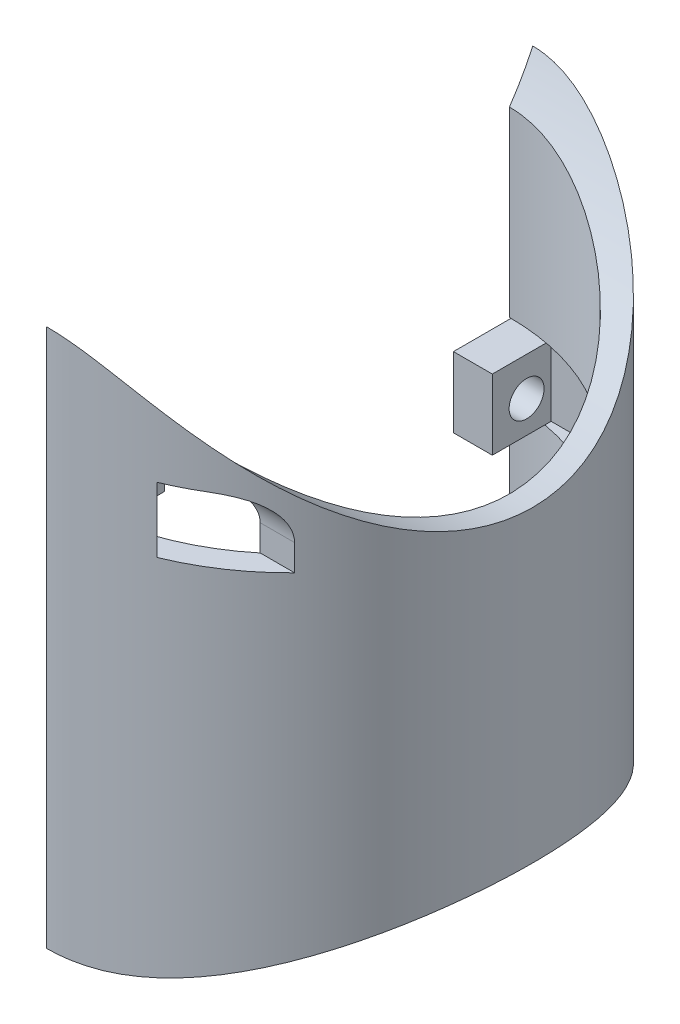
ISO-10303-21;
HEADER;
FILE_DESCRIPTION(('STEP AP214'),'2;1');
FILE_NAME('part.step','',(''),(''),'','','');
FILE_SCHEMA(('AUTOMOTIVE_DESIGN { 1 0 10303 214 1 1 1 1 }'));
ENDSEC;
DATA;
#1=APPLICATION_CONTEXT('core data for automotive mechanical design processes');
#2=APPLICATION_PROTOCOL_DEFINITION('international standard','automotive_design',2000,#1);
#3=PRODUCT_CONTEXT('',#1,'mechanical');
#4=PRODUCT('Part','Part','',(#3));
#5=PRODUCT_RELATED_PRODUCT_CATEGORY('part','',(#4));
#6=PRODUCT_DEFINITION_FORMATION('','',#4);
#7=PRODUCT_DEFINITION_CONTEXT('part definition',#1,'design');
#8=PRODUCT_DEFINITION('design','',#6,#7);
#9=PRODUCT_DEFINITION_SHAPE('','',#8);
#10=(LENGTH_UNIT() NAMED_UNIT(*) SI_UNIT(.MILLI.,.METRE.));
#11=(NAMED_UNIT(*) PLANE_ANGLE_UNIT() SI_UNIT($,.RADIAN.));
#12=(NAMED_UNIT(*) SI_UNIT($,.STERADIAN.) SOLID_ANGLE_UNIT());
#13=UNCERTAINTY_MEASURE_WITH_UNIT(LENGTH_MEASURE(1.E-05),#10,'distance_accuracy_value','');
#14=(GEOMETRIC_REPRESENTATION_CONTEXT(3) GLOBAL_UNCERTAINTY_ASSIGNED_CONTEXT((#13)) GLOBAL_UNIT_ASSIGNED_CONTEXT((#10,
#11,#12)) REPRESENTATION_CONTEXT('',''));
#15=CARTESIAN_POINT('',(0.,0.,0.));
#16=DIRECTION('',(0.,0.,1.));
#17=DIRECTION('',(1.,0.,0.));
#18=AXIS2_PLACEMENT_3D('',#15,#16,#17);
#19=CARTESIAN_POINT('',(0.,90.,0.));
#20=DIRECTION('',(0.,-1.,0.));
#21=DIRECTION('',(0.,0.,-1.));
#22=AXIS2_PLACEMENT_3D('',#19,#20,#21);
#23=CYLINDRICAL_SURFACE('',#22,11.3);
#24=DIRECTION('',(0.,-1.,0.));
#25=VECTOR('',#24,1.);
#26=CARTESIAN_POINT('',(0.,90.,-11.3));
#27=LINE('',#26,#25);
#28=CARTESIAN_POINT('',(0.,37.1354963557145,-11.3));
#29=VERTEX_POINT('',#28);
#30=CARTESIAN_POINT('',(0.,48.8838785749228,-11.3));
#31=VERTEX_POINT('',#30);
#32=EDGE_CURVE('E226',#29,#31,#27,.F.);
#33=ORIENTED_EDGE('',*,*,#32,.F.);
#34=CARTESIAN_POINT('',(0.,37.1354963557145,-11.3));
#35=CARTESIAN_POINT('',(0.14780555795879,37.1354929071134,-11.3000011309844));
#36=CARTESIAN_POINT('',(0.295590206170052,37.1371876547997,-11.297099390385));
#37=CARTESIAN_POINT('',(0.590847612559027,37.1439382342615,-11.2855095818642));
#38=CARTESIAN_POINT('',(0.73832038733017,37.1489938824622,-11.2768218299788));
#39=CARTESIAN_POINT('',(1.17963864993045,37.1691380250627,-11.2421279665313));
#40=CARTESIAN_POINT('',(1.472637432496,37.1892038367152,-11.2074911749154));
#41=CARTESIAN_POINT('',(2.05218821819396,37.2417027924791,-11.1159406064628));
#42=CARTESIAN_POINT('',(2.33876777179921,37.2740634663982,-11.0591573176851));
#43=CARTESIAN_POINT('',(2.90529727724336,37.3500057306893,-10.9240131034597));
#44=CARTESIAN_POINT('',(3.18524644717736,37.3935886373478,-10.8456496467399));
#45=CARTESIAN_POINT('',(3.73607288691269,37.4904083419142,-10.6684234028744));
#46=CARTESIAN_POINT('',(4.00697064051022,37.543621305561,-10.5696111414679));
#47=CARTESIAN_POINT('',(4.53902495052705,37.6581547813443,-10.352290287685));
#48=CARTESIAN_POINT('',(4.80017767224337,37.7194784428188,-10.2337740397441));
#49=CARTESIAN_POINT('',(5.56763658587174,37.9131852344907,-9.8498070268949));
#50=CARTESIAN_POINT('',(6.05761856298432,38.0552436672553,-9.55604367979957));
#51=CARTESIAN_POINT('',(7.02412474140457,38.3634177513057,-8.873015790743));
#52=CARTESIAN_POINT('',(7.49615125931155,38.5305515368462,-8.47784582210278));
#53=CARTESIAN_POINT('',(8.15172982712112,38.7788757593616,-7.83158372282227));
#54=CARTESIAN_POINT('',(8.36162654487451,38.8613048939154,-7.60708903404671));
#55=CARTESIAN_POINT('',(8.76285181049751,39.0234238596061,-7.14120717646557));
#56=CARTESIAN_POINT('',(8.95418705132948,39.103114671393,-6.89982615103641));
#57=CARTESIAN_POINT('',(9.32968578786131,39.2632010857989,-6.38401553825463));
#58=CARTESIAN_POINT('',(9.51243930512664,39.3432646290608,-6.10845485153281));
#59=CARTESIAN_POINT('',(9.85389984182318,39.4958614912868,-5.54079010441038));
#60=CARTESIAN_POINT('',(10.01260545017,39.5683943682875,-5.24868507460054));
#61=CARTESIAN_POINT('',(10.3043196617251,39.7038058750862,-4.64992866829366));
#62=CARTESIAN_POINT('',(10.4373406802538,39.766689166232,-4.34328440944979));
#63=CARTESIAN_POINT('',(10.6762396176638,39.8809518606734,-3.71752988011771));
#64=CARTESIAN_POINT('',(10.7821204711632,39.9323325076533,-3.39842096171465));
#65=CARTESIAN_POINT('',(10.9587606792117,40.0187544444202,-2.77366727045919));
#66=CARTESIAN_POINT('',(11.0315001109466,40.0547059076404,-2.46870769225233));
#67=CARTESIAN_POINT('',(11.1515127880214,40.11430995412,-1.85262760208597));
#68=CARTESIAN_POINT('',(11.1987871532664,40.1379630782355,-1.54150736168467));
#69=CARTESIAN_POINT('',(11.26721799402,40.1722743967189,-0.915851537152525));
#70=CARTESIAN_POINT('',(11.2883875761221,40.182939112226,-0.60131774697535));
#71=CARTESIAN_POINT('',(11.3043539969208,40.1909781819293,0.02858027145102));
#72=CARTESIAN_POINT('',(11.2991524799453,40.1883533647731,0.343944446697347));
#73=CARTESIAN_POINT('',(11.2640816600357,40.1707136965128,0.944944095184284));
#74=CARTESIAN_POINT('',(11.2364316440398,40.1568136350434,1.23074517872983));
#75=CARTESIAN_POINT('',(11.1596057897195,40.1183828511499,1.7986949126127));
#76=CARTESIAN_POINT('',(11.1104314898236,40.0938528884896,2.0808438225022));
#77=CARTESIAN_POINT('',(10.9910963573,40.0347493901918,2.63958696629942));
#78=CARTESIAN_POINT('',(10.9209352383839,40.0001757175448,2.91618112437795));
#79=CARTESIAN_POINT('',(10.7603434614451,39.9217881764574,3.46207521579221));
#80=CARTESIAN_POINT('',(10.6699120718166,39.877973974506,3.73137488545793));
#81=CARTESIAN_POINT('',(10.4682803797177,39.7814440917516,4.26467629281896));
#82=CARTESIAN_POINT('',(10.3568176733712,39.7286168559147,4.52855845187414));
#83=CARTESIAN_POINT('',(10.1148564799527,39.6156308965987,5.04591580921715));
#84=CARTESIAN_POINT('',(9.98435124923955,39.5554695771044,5.29938727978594));
#85=CARTESIAN_POINT('',(9.7053311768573,39.4291192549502,5.79459333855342));
#86=CARTESIAN_POINT('',(9.5568182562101,39.3629308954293,6.03632917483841));
#87=CARTESIAN_POINT('',(9.24267594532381,39.2258591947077,6.50715589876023));
#88=CARTESIAN_POINT('',(9.07703879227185,39.154973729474,6.73624097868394));
#89=CARTESIAN_POINT('',(8.71307416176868,39.0030554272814,7.20192973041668));
#90=CARTESIAN_POINT('',(8.51313566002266,38.9216992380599,7.43717038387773));
#91=CARTESIAN_POINT('',(8.09507008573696,38.757067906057,7.89017452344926));
#92=CARTESIAN_POINT('',(7.8769419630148,38.673792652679,8.10793699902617));
#93=CARTESIAN_POINT('',(7.42342548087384,38.5072983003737,8.52512514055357));
#94=CARTESIAN_POINT('',(7.18802319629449,38.4240793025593,8.72453571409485));
#95=CARTESIAN_POINT('',(6.70117508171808,38.259875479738,9.10381730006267));
#96=CARTESIAN_POINT('',(6.44972676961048,38.178891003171,9.28368527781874));
#97=CARTESIAN_POINT('',(5.91479298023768,38.0161412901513,9.63400668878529));
#98=CARTESIAN_POINT('',(5.63028856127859,37.9346789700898,9.80304964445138));
#99=CARTESIAN_POINT('',(5.0459999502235,37.7795477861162,10.1162089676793));
#100=CARTESIAN_POINT('',(4.74622284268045,37.7058753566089,10.2603367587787));
#101=CARTESIAN_POINT('',(4.13363723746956,37.5691099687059,10.5220616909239));
#102=CARTESIAN_POINT('',(3.82085373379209,37.5059977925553,10.6397071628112));
#103=CARTESIAN_POINT('',(3.18400898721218,37.3927683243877,10.847309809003));
#104=CARTESIAN_POINT('',(2.85995268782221,37.342645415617,10.937278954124));
#105=CARTESIAN_POINT('',(2.32551038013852,37.2734250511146,11.0601442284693));
#106=CARTESIAN_POINT('',(2.11769244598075,37.2497227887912,11.1018205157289));
#107=CARTESIAN_POINT('',(1.69946236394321,37.20874199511,11.1734870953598));
#108=CARTESIAN_POINT('',(1.48905095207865,37.1914616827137,11.2034806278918));
#109=CARTESIAN_POINT('',(1.06603862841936,37.1636409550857,11.2516194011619));
#110=CARTESIAN_POINT('',(0.853434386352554,37.1531130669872,11.2697426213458));
#111=CARTESIAN_POINT('',(0.427223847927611,37.1390268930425,11.2939431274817));
#112=CARTESIAN_POINT('',(0.213617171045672,37.1354715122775,11.3000153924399));
#113=CARTESIAN_POINT('',(0.,37.1354963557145,11.3));
#114=B_SPLINE_CURVE_WITH_KNOTS('',3,(#34,#35,#36,#37,#38,#39,#40,#41,#42,#43,#44,#45,#46,#47,
#48,#49,#50,#51,#52,#53,#54,#55,#56,#57,#58,#59,#60,#61,#62,#63,#64,#65,#66,#67,#68,#69,#70,#71,
#72,#73,#74,#75,#76,#77,#78,#79,#80,#81,#82,#83,#84,#85,#86,#87,#88,#89,#90,#91,#92,#93,#94,#95,
#96,#97,#98,#99,#100,#101,#102,#103,#104,#105,#106,#107,#108,#109,#110,#111,#112,#113),
.UNSPECIFIED.,.F.,.F.,(4,2,2,2,2,2,2,2,2,2,2,2,2,2,2,2,2,2,2,2,2,2,2,2,2,2,2,2,2,2,2,2,2,2,2,2,
2,2,2,4),(0.,0.443337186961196,0.886650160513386,1.77251885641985,2.65324496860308,
3.53407443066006,4.4127529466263,5.29177365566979,7.05084459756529,8.95601493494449,
9.90978591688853,10.8632116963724,11.8825424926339,12.9019330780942,13.9208296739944,
14.9396160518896,15.885038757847,16.8304198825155,17.7753261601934,18.7201735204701,
19.5815699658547,20.4429048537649,21.304251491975,22.1656292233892,23.0385653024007,
23.9118112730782,24.7849641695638,25.6585146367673,26.6152895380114,27.572119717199,
28.5297298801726,29.4874885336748,30.5086212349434,31.5292845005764,32.5480696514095,
33.566413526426,34.205859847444,34.8451286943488,35.4855801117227,36.1262983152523),.UNSPECIFIED.);
#115=CARTESIAN_POINT('',(0.,37.1354963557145,11.3));
#116=VERTEX_POINT('',#115);
#117=EDGE_CURVE('E54',#29,#116,#114,.T.);
#118=ORIENTED_EDGE('',*,*,#117,.T.);
#119=DIRECTION('',(0.,-1.,0.));
#120=VECTOR('',#119,1.);
#121=CARTESIAN_POINT('',(0.,90.,11.3));
#122=LINE('',#121,#120);
#123=CARTESIAN_POINT('',(0.,55.6975378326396,11.3));
#124=VERTEX_POINT('',#123);
#125=EDGE_CURVE('E225',#124,#116,#122,.T.);
#126=ORIENTED_EDGE('',*,*,#125,.F.);
#127=CARTESIAN_POINT('',(0.,55.6975378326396,0.));
#128=DIRECTION('',(0.,1.,0.));
#129=DIRECTION('',(0.,0.,1.));
#130=AXIS2_PLACEMENT_3D('',#127,#128,#129);
#131=CIRCLE('',#130,11.3);
#132=CARTESIAN_POINT('',(2.,55.6975378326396,11.1216006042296));
#133=VERTEX_POINT('',#132);
#134=EDGE_CURVE('E241',#124,#133,#131,.T.);
#135=ORIENTED_EDGE('',*,*,#134,.T.);
#136=CARTESIAN_POINT('',(7.19722769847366,55.6975378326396,8.7114817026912));
#137=VERTEX_POINT('',#136);
#138=EDGE_CURVE('E240',#133,#137,#131,.T.);
#139=ORIENTED_EDGE('',*,*,#138,.T.);
#140=DIRECTION('',(0.,-1.,0.));
#141=VECTOR('',#140,1.);
#142=CARTESIAN_POINT('',(7.19722769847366,90.,8.7114817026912));
#143=LINE('',#142,#141);
#144=CARTESIAN_POINT('',(7.19722769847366,57.0447512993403,8.7114817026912));
#145=VERTEX_POINT('',#144);
#146=EDGE_CURVE('E237',#137,#145,#143,.F.);
#147=ORIENTED_EDGE('',*,*,#146,.T.);
#148=CARTESIAN_POINT('',(7.19722769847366,57.0447512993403,8.7114817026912));
#149=CARTESIAN_POINT('',(7.19723766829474,57.0859571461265,8.71147066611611));
#150=CARTESIAN_POINT('',(7.19568670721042,57.127155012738,8.71275477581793));
#151=CARTESIAN_POINT('',(7.1895401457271,57.2091356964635,8.71782893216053));
#152=CARTESIAN_POINT('',(7.18494696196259,57.2499188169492,8.72161698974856));
#153=CARTESIAN_POINT('',(7.17284730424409,57.3303760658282,8.73157022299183));
#154=CARTESIAN_POINT('',(7.16536725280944,57.3700568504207,8.73771383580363));
#155=CARTESIAN_POINT('',(7.14763320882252,57.4483700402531,8.75222663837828));
#156=CARTESIAN_POINT('',(7.13737883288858,57.4870022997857,8.76059613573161));
#157=CARTESIAN_POINT('',(7.10275987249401,57.6006919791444,8.78872494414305));
#158=CARTESIAN_POINT('',(7.07449110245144,57.6738524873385,8.81154500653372));
#159=CARTESIAN_POINT('',(7.00907048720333,57.8136473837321,8.86367190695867));
#160=CARTESIAN_POINT('',(6.97189847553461,57.8802664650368,8.89299345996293));
#161=CARTESIAN_POINT('',(6.87360507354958,58.0320461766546,8.96932586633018));
#162=CARTESIAN_POINT('',(6.80889656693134,58.1137021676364,9.01867646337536));
#163=CARTESIAN_POINT('',(6.66875269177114,58.2631149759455,9.12279455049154));
#164=CARTESIAN_POINT('',(6.59329772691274,58.3308458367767,9.17757187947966));
#165=CARTESIAN_POINT('',(6.45252665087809,58.4397612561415,9.27688379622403));
#166=CARTESIAN_POINT('',(6.38878390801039,58.4834840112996,9.3209288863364));
#167=CARTESIAN_POINT('',(6.25748369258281,58.5641737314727,9.40957873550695));
#168=CARTESIAN_POINT('',(6.1899240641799,58.6011368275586,9.45418379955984));
#169=CARTESIAN_POINT('',(6.05165107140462,58.6690855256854,9.5432854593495));
#170=CARTESIAN_POINT('',(5.98093293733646,58.7000616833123,9.58778177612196));
#171=CARTESIAN_POINT('',(5.83697309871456,58.7566892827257,9.67609885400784));
#172=CARTESIAN_POINT('',(5.76373045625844,58.782338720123,9.7199193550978));
#173=CARTESIAN_POINT('',(5.55542137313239,58.8477165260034,9.84130596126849));
#174=CARTESIAN_POINT('',(5.41799635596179,58.8821829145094,9.91767559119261));
#175=CARTESIAN_POINT('',(5.13811209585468,58.9392230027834,10.0655317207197));
#176=CARTESIAN_POINT('',(4.99564844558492,58.961786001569,10.1370137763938));
#177=CARTESIAN_POINT('',(4.70678402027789,58.9976801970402,10.2743263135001));
#178=CARTESIAN_POINT('',(4.56038013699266,59.0110038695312,10.340152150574));
#179=CARTESIAN_POINT('',(4.26458765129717,59.0305954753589,10.4656149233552));
#180=CARTESIAN_POINT('',(4.11520049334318,59.0368667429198,10.525254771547));
#181=CARTESIAN_POINT('',(3.9039878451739,59.0420109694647,10.6043891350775));
#182=CARTESIAN_POINT('',(3.84319908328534,59.0430655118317,10.6265709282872));
#183=CARTESIAN_POINT('',(3.72139537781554,59.0444344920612,10.6698351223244));
#184=CARTESIAN_POINT('',(3.66038138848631,59.0447507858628,10.6909201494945));
#185=CARTESIAN_POINT('',(3.59918876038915,59.0447512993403,10.7114817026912));
#186=B_SPLINE_CURVE_WITH_KNOTS('',3,(#148,#149,#150,#151,#152,#153,#154,#155,#156,#157,#158,
#159,#160,#161,#162,#163,#164,#165,#166,#167,#168,#169,#170,#171,#172,#173,#174,#175,#176,#177,
#178,#179,#180,#181,#182,#183,#184,#185),.UNSPECIFIED.,.F.,.F.,(4,2,2,2,2,2,2,2,2,2,2,2,2,2,2,2,
2,2,4),(0.,0.12355539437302,0.247012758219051,0.369365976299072,0.491736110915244,
0.735540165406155,0.979901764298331,1.32382571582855,1.66838504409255,1.93491875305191,
2.20160453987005,2.46870765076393,2.73591108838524,3.21795822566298,3.70043798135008,
4.1833101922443,4.66595401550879,4.86009787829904,5.05375313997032),.UNSPECIFIED.);
#187=CARTESIAN_POINT('',(3.59918876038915,59.0447512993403,10.7114817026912));
#188=VERTEX_POINT('',#187);
#189=EDGE_CURVE('E47',#145,#188,#186,.T.);
#190=ORIENTED_EDGE('',*,*,#189,.T.);
#191=CARTESIAN_POINT('',(0.,59.0447512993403,0.));
#192=DIRECTION('',(0.,-1.,0.));
#193=DIRECTION('',(0.,0.,-1.));
#194=AXIS2_PLACEMENT_3D('',#191,#192,#193);
#195=CIRCLE('',#194,11.3);
#196=CARTESIAN_POINT('',(2.,59.0447512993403,11.1216006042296));
#197=VERTEX_POINT('',#196);
#198=EDGE_CURVE('E235',#188,#197,#195,.T.);
#199=ORIENTED_EDGE('',*,*,#198,.T.);
#200=DIRECTION('',(0.,-1.,0.));
#201=VECTOR('',#200,1.);
#202=CARTESIAN_POINT('',(2.,90.,11.1216006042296));
#203=LINE('',#202,#201);
#204=CARTESIAN_POINT('',(2.,59.8028216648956,11.1216006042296));
#205=VERTEX_POINT('',#204);
#206=EDGE_CURVE('E354',#197,#205,#203,.F.);
#207=ORIENTED_EDGE('',*,*,#206,.T.);
#208=CARTESIAN_POINT('',(0.,59.8028216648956,0.));
#209=DIRECTION('',(0.,-1.,0.));
#210=DIRECTION('',(0.,0.,-1.));
#211=AXIS2_PLACEMENT_3D('',#208,#209,#210);
#212=CIRCLE('',#211,11.3);
#213=CARTESIAN_POINT('',(0.,59.8028216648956,11.3));
#214=VERTEX_POINT('',#213);
#215=EDGE_CURVE('E252',#205,#214,#212,.T.);
#216=ORIENTED_EDGE('',*,*,#215,.T.);
#217=CARTESIAN_POINT('',(0.,61.9500774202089,11.3));
#218=VERTEX_POINT('',#217);
#219=EDGE_CURVE('E220',#218,#214,#122,.T.);
#220=ORIENTED_EDGE('',*,*,#219,.F.);
#221=CARTESIAN_POINT('',(0.,61.9500774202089,11.3));
#222=CARTESIAN_POINT('',(0.102958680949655,61.9500838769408,11.3000018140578));
#223=CARTESIAN_POINT('',(0.205900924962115,61.9480379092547,11.2985924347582));
#224=CARTESIAN_POINT('',(0.411535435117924,61.9399032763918,11.2929717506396));
#225=CARTESIAN_POINT('',(0.51422773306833,61.933815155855,11.2887608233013));
#226=CARTESIAN_POINT('',(0.821222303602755,61.909613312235,11.2719789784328));
#227=CARTESIAN_POINT('',(1.0248693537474,61.8855615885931,11.2552588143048));
#228=CARTESIAN_POINT('',(1.42578443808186,61.8232822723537,11.211478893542));
#229=CARTESIAN_POINT('',(1.62310200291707,61.7852611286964,11.1845695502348));
#230=CARTESIAN_POINT('',(2.01335955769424,61.6966720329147,11.1209487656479));
#231=CARTESIAN_POINT('',(2.20629715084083,61.6460973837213,11.0842320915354));
#232=CARTESIAN_POINT('',(2.66012575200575,61.5128083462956,10.9857366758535));
#233=CARTESIAN_POINT('',(2.91866930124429,61.4252091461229,10.9197478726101));
#234=CARTESIAN_POINT('',(3.42513177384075,61.2344425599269,10.7716372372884));
#235=CARTESIAN_POINT('',(3.6730465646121,61.1312691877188,10.6895091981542));
#236=CARTESIAN_POINT('',(4.16004916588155,60.9127838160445,10.50960906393));
#237=CARTESIAN_POINT('',(4.39905570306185,60.7973856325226,10.4117229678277));
#238=CARTESIAN_POINT('',(4.86650147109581,60.5586805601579,10.2016088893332));
#239=CARTESIAN_POINT('',(5.09494084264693,60.4353737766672,10.0893810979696));
#240=CARTESIAN_POINT('',(5.63417252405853,60.1316214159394,9.80175165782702));
#241=CARTESIAN_POINT('',(5.9398827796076,59.9486641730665,9.61943771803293));
#242=CARTESIAN_POINT('',(6.53148122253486,59.5792485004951,9.22797801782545));
#243=CARTESIAN_POINT('',(6.81736143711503,59.3927887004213,9.01882156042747));
#244=CARTESIAN_POINT('',(7.36841310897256,59.0220489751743,8.57446696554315));
#245=CARTESIAN_POINT('',(7.63362624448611,58.8377653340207,8.33932368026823));
#246=CARTESIAN_POINT('',(8.14291654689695,58.4756236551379,7.84278673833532));
#247=CARTESIAN_POINT('',(8.38700137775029,58.2977633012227,7.58140267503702));
#248=CARTESIAN_POINT('',(8.80410190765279,57.9884907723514,7.08936856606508));
#249=CARTESIAN_POINT('',(8.98136773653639,57.8550871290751,6.86356279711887));
#250=CARTESIAN_POINT('',(9.32028395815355,57.5971607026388,6.39575638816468));
#251=CARTESIAN_POINT('',(9.48193748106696,57.4726361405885,6.1537590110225));
#252=CARTESIAN_POINT('',(9.7880116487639,57.2347464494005,5.65424931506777));
#253=CARTESIAN_POINT('',(9.93244950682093,57.1213701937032,5.39675288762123));
#254=CARTESIAN_POINT('',(10.2025589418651,56.9078504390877,4.86684466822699));
#255=CARTESIAN_POINT('',(10.328233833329,56.8077046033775,4.59443552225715));
#256=CARTESIAN_POINT('',(10.5394310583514,56.6384941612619,4.08330465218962));
#257=CARTESIAN_POINT('',(10.628148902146,56.5670381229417,3.84669152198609));
#258=CARTESIAN_POINT('',(10.7902983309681,56.4359704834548,3.3651125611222));
#259=CARTESIAN_POINT('',(10.8637329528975,56.3763565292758,3.12014840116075));
#260=CARTESIAN_POINT('',(10.9942958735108,56.2700846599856,2.62324570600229));
#261=CARTESIAN_POINT('',(11.0514302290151,56.2234219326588,2.3713097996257));
#262=CARTESIAN_POINT('',(11.1485526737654,56.1439581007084,1.86198195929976));
#263=CARTESIAN_POINT('',(11.1885405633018,56.1111571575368,1.6045899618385));
#264=CARTESIAN_POINT('',(11.250825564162,56.0600170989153,1.08517747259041));
#265=CARTESIAN_POINT('',(11.2730508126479,56.0417367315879,0.823142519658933));
#266=CARTESIAN_POINT('',(11.2991461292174,56.0202696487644,0.29753817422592));
#267=CARTESIAN_POINT('',(11.3030161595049,56.0170829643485,0.0339687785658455));
#268=CARTESIAN_POINT('',(11.2923310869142,56.0258758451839,-0.492534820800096));
#269=CARTESIAN_POINT('',(11.2777762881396,56.0378551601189,-0.755469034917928));
#270=CARTESIAN_POINT('',(11.2305035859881,56.0767079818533,-1.27857548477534));
#271=CARTESIAN_POINT('',(11.1977862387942,56.103581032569,-1.53874780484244));
#272=CARTESIAN_POINT('',(11.1173856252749,56.1694728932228,-2.03803494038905));
#273=CARTESIAN_POINT('',(11.0707796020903,56.2076161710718,-2.27744095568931));
#274=CARTESIAN_POINT('',(10.9627928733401,56.2957484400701,-2.75064853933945));
#275=CARTESIAN_POINT('',(10.901412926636,56.3457368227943,-2.98445039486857));
#276=CARTESIAN_POINT('',(10.7646697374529,56.4567063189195,-3.44523560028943));
#277=CARTESIAN_POINT('',(10.6893065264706,56.5176874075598,-3.6722189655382));
#278=CARTESIAN_POINT('',(10.5254368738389,56.6497049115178,-4.11845895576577));
#279=CARTESIAN_POINT('',(10.4369256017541,56.7207450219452,-4.33771270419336));
#280=CARTESIAN_POINT('',(10.2392489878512,56.8785670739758,-4.78677307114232));
#281=CARTESIAN_POINT('',(10.1289468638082,56.9661871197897,-5.0157841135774));
#282=CARTESIAN_POINT('',(9.89491434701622,57.1508033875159,-5.46300313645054));
#283=CARTESIAN_POINT('',(9.7711784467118,57.2478034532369,-5.68120663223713));
#284=CARTESIAN_POINT('',(9.51135261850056,57.4497988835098,-6.10624414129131));
#285=CARTESIAN_POINT('',(9.37526242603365,57.5547944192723,-6.31307791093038));
#286=CARTESIAN_POINT('',(9.09164446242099,57.7714509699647,-6.71509732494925));
#287=CARTESIAN_POINT('',(8.94411509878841,57.8831129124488,-6.91028134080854));
#288=CARTESIAN_POINT('',(8.60669592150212,58.1355072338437,-7.32810280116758));
#289=CARTESIAN_POINT('',(8.4143677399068,58.2774645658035,-7.54803474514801));
#290=CARTESIAN_POINT('',(8.0152941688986,58.566861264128,-7.97054152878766));
#291=CARTESIAN_POINT('',(7.80854658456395,58.7143014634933,-8.17311371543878));
#292=CARTESIAN_POINT('',(7.38110617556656,59.0124923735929,-8.56111615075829));
#293=CARTESIAN_POINT('',(7.16039365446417,59.1632475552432,-8.74652123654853));
#294=CARTESIAN_POINT('',(6.70573345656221,59.4652973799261,-9.09978143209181));
#295=CARTESIAN_POINT('',(6.47178685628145,59.6165919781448,-9.26763796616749));
#296=CARTESIAN_POINT('',(5.99605322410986,59.9135213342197,-9.58211016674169));
#297=CARTESIAN_POINT('',(5.75455528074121,60.0592071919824,-9.72911445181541));
#298=CARTESIAN_POINT('',(5.25868708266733,60.3451905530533,-10.0058416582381));
#299=CARTESIAN_POINT('',(5.00431415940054,60.4854869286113,-10.1355609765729));
#300=CARTESIAN_POINT('',(4.48264882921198,60.7565258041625,-10.3768141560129));
#301=CARTESIAN_POINT('',(4.21537595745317,60.8872820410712,-10.4883744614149));
#302=CARTESIAN_POINT('',(3.66742259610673,61.1344118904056,-10.6923121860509));
#303=CARTESIAN_POINT('',(3.38675052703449,61.2507943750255,-10.7847014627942));
#304=CARTESIAN_POINT('',(2.72374361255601,61.4955374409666,-10.9737437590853));
#305=CARTESIAN_POINT('',(2.3364730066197,61.6167572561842,-11.0631313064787));
#306=CARTESIAN_POINT('',(1.74189140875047,61.7602632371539,-11.1667472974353));
#307=CARTESIAN_POINT('',(1.54170843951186,61.8016799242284,-11.1961883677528));
#308=CARTESIAN_POINT('',(1.13766035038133,61.8700579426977,-11.2444217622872));
#309=CARTESIAN_POINT('',(0.933797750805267,61.8970288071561,-11.2632211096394));
#310=CARTESIAN_POINT('',(0.607961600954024,61.9273488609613,-11.2842849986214));
#311=CARTESIAN_POINT('',(0.486672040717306,61.935848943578,-11.2901684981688));
#312=CARTESIAN_POINT('',(0.24359632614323,61.9472231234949,-11.2980299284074));
#313=CARTESIAN_POINT('',(0.121809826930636,61.9500922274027,-11.3000043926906));
#314=CARTESIAN_POINT('',(0.,61.9500774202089,-11.3));
#315=B_SPLINE_CURVE_WITH_KNOTS('',3,(#221,#222,#223,#224,#225,#226,#227,#228,#229,#230,#231,
#232,#233,#234,#235,#236,#237,#238,#239,#240,#241,#242,#243,#244,#245,#246,#247,#248,#249,#250,
#251,#252,#253,#254,#255,#256,#257,#258,#259,#260,#261,#262,#263,#264,#265,#266,#267,#268,#269,
#270,#271,#272,#273,#274,#275,#276,#277,#278,#279,#280,#281,#282,#283,#284,#285,#286,#287,#288,
#289,#290,#291,#292,#293,#294,#295,#296,#297,#298,#299,#300,#301,#302,#303,#304,#305,#306,#307,
#308,#309,#310,#311,#312,#313,#314),.UNSPECIFIED.,.F.,.F.,(4,2,2,2,2,2,2,2,2,2,2,2,2,2,2,2,2,2,
2,2,2,2,2,2,2,2,2,2,2,2,2,2,2,2,2,2,2,2,2,2,2,2,2,2,2,2,4),(0.,0.308814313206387,
0.617587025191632,1.23385642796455,1.8413622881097,2.44919294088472,3.29036814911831,
4.13186750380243,4.97975348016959,5.82762816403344,7.0267021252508,8.22625542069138,
9.42332342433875,10.6199553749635,11.568789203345,12.5174323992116,13.4651189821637,
14.4126379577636,15.1996780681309,15.9865616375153,16.7731524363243,17.5597523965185,
18.3495188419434,19.1392869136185,19.92904195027,20.7187728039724,21.4585630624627,
22.1983153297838,22.9380659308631,23.6780889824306,24.4839239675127,25.2900905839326,
26.0962744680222,26.902570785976,27.8761464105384,28.8498705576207,29.8250000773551,
30.8000503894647,31.7534688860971,32.7070858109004,33.6593013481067,34.6109261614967,
35.8522736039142,36.471214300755,37.0897460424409,37.4547581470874,37.8200937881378),.UNSPECIFIED.);
#316=CARTESIAN_POINT('',(0.,61.9500774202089,-11.3));
#317=VERTEX_POINT('',#316);
#318=EDGE_CURVE('E274',#218,#317,#315,.T.);
#319=ORIENTED_EDGE('',*,*,#318,.T.);
#320=CARTESIAN_POINT('',(0.,52.5828890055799,-11.3));
#321=VERTEX_POINT('',#320);
#322=EDGE_CURVE('E227',#321,#317,#27,.F.);
#323=ORIENTED_EDGE('',*,*,#322,.F.);
#324=CARTESIAN_POINT('',(0.,52.58288900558,0.));
#325=DIRECTION('',(0.,-1.,0.));
#326=DIRECTION('',(0.,0.,-1.));
#327=AXIS2_PLACEMENT_3D('',#324,#325,#326);
#328=CIRCLE('',#327,11.3);
#329=CARTESIAN_POINT('',(7.06519370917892,52.58288900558,-8.81890230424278));
#330=VERTEX_POINT('',#329);
#331=EDGE_CURVE('E215',#321,#330,#328,.T.);
#332=ORIENTED_EDGE('',*,*,#331,.T.);
#333=DIRECTION('',(0.,-1.,0.));
#334=VECTOR('',#333,1.);
#335=CARTESIAN_POINT('',(7.06519370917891,90.,-8.81890230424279));
#336=LINE('',#335,#334);
#337=CARTESIAN_POINT('',(7.06519370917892,48.8838785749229,-8.81890230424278));
#338=VERTEX_POINT('',#337);
#339=EDGE_CURVE('E218',#330,#338,#336,.T.);
#340=ORIENTED_EDGE('',*,*,#339,.T.);
#341=CARTESIAN_POINT('',(0.,48.8838785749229,0.));
#342=DIRECTION('',(0.,1.,0.));
#343=DIRECTION('',(0.,0.,1.));
#344=AXIS2_PLACEMENT_3D('',#341,#342,#343);
#345=CIRCLE('',#344,11.3);
#346=CARTESIAN_POINT('',(2.,48.8838785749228,-11.1216006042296));
#347=VERTEX_POINT('',#346);
#348=EDGE_CURVE('E232',#338,#347,#345,.T.);
#349=ORIENTED_EDGE('',*,*,#348,.T.);
#350=EDGE_CURVE('E231',#347,#31,#345,.T.);
#351=ORIENTED_EDGE('',*,*,#350,.T.);
#352=EDGE_LOOP('',(#33,#118,#126,#135,#139,#147,#190,#199,#207,#216,#220,#319,#323,#332,#340,
#349,#351));
#353=FACE_BOUND('',#352,.T.);
#354=ADVANCED_FACE('F33',(#353),#23,.F.);
#355=CARTESIAN_POINT('',(0.,90.,0.));
#356=DIRECTION('',(0.,-1.,0.));
#357=DIRECTION('',(0.,0.,-1.));
#358=AXIS2_PLACEMENT_3D('',#355,#356,#357);
#359=CYLINDRICAL_SURFACE('',#358,12.5);
#360=DIRECTION('',(0.,-1.,0.));
#361=VECTOR('',#360,1.);
#362=CARTESIAN_POINT('',(8.8587223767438,90.,-8.81890230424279));
#363=LINE('',#362,#361);
#364=CARTESIAN_POINT('',(8.8587223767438,52.58288900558,-8.81890230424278));
#365=VERTEX_POINT('',#364);
#366=CARTESIAN_POINT('',(8.8587223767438,48.8838785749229,-8.81890230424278));
#367=VERTEX_POINT('',#366);
#368=EDGE_CURVE('E386',#365,#367,#363,.T.);
#369=ORIENTED_EDGE('',*,*,#368,.F.);
#370=CARTESIAN_POINT('',(0.,52.58288900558,0.));
#371=DIRECTION('',(0.,-1.,0.));
#372=DIRECTION('',(0.,0.,-1.));
#373=AXIS2_PLACEMENT_3D('',#370,#371,#372);
#374=CIRCLE('',#373,12.5);
#375=CARTESIAN_POINT('',(5.03032165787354,52.58288900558,-11.4431579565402));
#376=VERTEX_POINT('',#375);
#377=EDGE_CURVE('E368',#376,#365,#374,.T.);
#378=ORIENTED_EDGE('',*,*,#377,.F.);
#379=DIRECTION('',(0.,-1.,0.));
#380=VECTOR('',#379,1.);
#381=CARTESIAN_POINT('',(5.03032165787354,90.,-11.4431579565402));
#382=LINE('',#381,#380);
#383=CARTESIAN_POINT('',(5.03032165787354,48.8838785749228,-11.4431579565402));
#384=VERTEX_POINT('',#383);
#385=EDGE_CURVE('E244',#384,#376,#382,.F.);
#386=ORIENTED_EDGE('',*,*,#385,.F.);
#387=CARTESIAN_POINT('',(0.,48.8838785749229,0.));
#388=DIRECTION('',(0.,1.,0.));
#389=DIRECTION('',(0.,0.,1.));
#390=AXIS2_PLACEMENT_3D('',#387,#388,#389);
#391=CIRCLE('',#390,12.5);
#392=EDGE_CURVE('E384',#367,#384,#391,.T.);
#393=ORIENTED_EDGE('',*,*,#392,.F.);
#394=EDGE_LOOP('',(#369,#378,#386,#393));
#395=FACE_BOUND('',#394,.T.);
#396=DIRECTION('',(0.,-1.,0.));
#397=VECTOR('',#396,1.);
#398=CARTESIAN_POINT('',(4.75238941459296,90.,11.5613491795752));
#399=LINE('',#398,#397);
#400=CARTESIAN_POINT('',(4.75238941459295,59.0447512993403,11.5613491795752));
#401=VERTEX_POINT('',#400);
#402=CARTESIAN_POINT('',(4.75238941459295,55.6975378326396,11.5613491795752));
#403=VERTEX_POINT('',#402);
#404=EDGE_CURVE('E247',#401,#403,#399,.T.);
#405=ORIENTED_EDGE('',*,*,#404,.F.);
#406=CARTESIAN_POINT('',(0.,59.0447512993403,0.));
#407=DIRECTION('',(0.,-1.,0.));
#408=DIRECTION('',(0.,0.,-1.));
#409=AXIS2_PLACEMENT_3D('',#406,#407,#408);
#410=CIRCLE('',#409,12.5);
#411=CARTESIAN_POINT('',(6.4431482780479,59.0447512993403,10.7114817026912));
#412=VERTEX_POINT('',#411);
#413=EDGE_CURVE('E388',#412,#401,#410,.T.);
#414=ORIENTED_EDGE('',*,*,#413,.F.);
#415=CARTESIAN_POINT('',(6.4431482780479,59.0447512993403,10.7114817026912));
#416=CARTESIAN_POINT('',(6.50863399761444,59.0447478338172,10.6720912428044));
#417=CARTESIAN_POINT('',(6.57375440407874,59.0435876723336,10.6321015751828));
#418=CARTESIAN_POINT('',(6.70320638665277,59.0387146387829,10.5509650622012));
#419=CARTESIAN_POINT('',(6.76753765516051,59.0350008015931,10.5098177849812));
#420=CARTESIAN_POINT('',(6.9599785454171,59.0196073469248,10.3842299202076));
#421=CARTESIAN_POINT('',(7.08672083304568,59.0036696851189,10.2981332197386));
#422=CARTESIAN_POINT('',(7.33734083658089,58.9578601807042,10.1211334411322));
#423=CARTESIAN_POINT('',(7.46114120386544,58.9277712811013,10.0301757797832));
#424=CARTESIAN_POINT('',(7.70176827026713,58.8508099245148,9.84659903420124));
#425=CARTESIAN_POINT('',(7.8186151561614,58.8039891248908,9.75398588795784));
#426=CARTESIAN_POINT('',(7.97649560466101,58.724092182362,9.62439845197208));
#427=CARTESIAN_POINT('',(8.02142297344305,58.6993129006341,9.58697553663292));
#428=CARTESIAN_POINT('',(8.10952342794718,58.6462180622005,9.51256812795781));
#429=CARTESIAN_POINT('',(8.15269640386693,58.6179022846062,9.47558366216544));
#430=CARTESIAN_POINT('',(8.27897243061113,58.5274868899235,9.3659474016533));
#431=CARTESIAN_POINT('',(8.35912298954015,58.4597765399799,9.29437315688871));
#432=CARTESIAN_POINT('',(8.50990655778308,58.3068255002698,9.15653044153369));
#433=CARTESIAN_POINT('',(8.58039391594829,58.2213570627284,9.09034822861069));
#434=CARTESIAN_POINT('',(8.67517032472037,58.0804592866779,8.99963120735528));
#435=CARTESIAN_POINT('',(8.70493048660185,58.031391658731,8.97082451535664));
#436=CARTESIAN_POINT('',(8.76032981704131,57.9291798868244,8.91673212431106));
#437=CARTESIAN_POINT('',(8.78597137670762,57.87603813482,8.8914443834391));
#438=CARTESIAN_POINT('',(8.84072040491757,57.7468907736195,8.83706007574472));
#439=CARTESIAN_POINT('',(8.86795330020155,57.6693401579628,8.80967690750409));
#440=CARTESIAN_POINT('',(8.91277887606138,57.5089690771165,8.76432557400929));
#441=CARTESIAN_POINT('',(8.93038993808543,57.4261589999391,8.74633945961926));
#442=CARTESIAN_POINT('',(8.94992492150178,57.2930302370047,8.72633635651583));
#443=CARTESIAN_POINT('',(8.95533181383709,57.2437137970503,8.7207841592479));
#444=CARTESIAN_POINT('',(8.96256303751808,57.1445254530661,8.71335029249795));
#445=CARTESIAN_POINT('',(8.96438590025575,57.0946533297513,8.71147012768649));
#446=CARTESIAN_POINT('',(8.96437875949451,57.0447512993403,8.7114817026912));
#447=B_SPLINE_CURVE_WITH_KNOTS('',3,(#415,#416,#417,#418,#419,#420,#421,#422,#423,#424,#425,
#426,#427,#428,#429,#430,#431,#432,#433,#434,#435,#436,#437,#438,#439,#440,#441,#442,#443,#444,
#445,#446),.UNSPECIFIED.,.F.,.F.,(4,2,2,2,2,2,2,2,2,2,2,2,2,2,2,4),(0.,0.229234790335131,
0.458556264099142,0.920042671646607,1.38885065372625,1.85622358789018,2.04663510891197,
2.23705852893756,2.61670693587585,3.00156356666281,3.19389366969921,3.38611170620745,
3.64489198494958,3.90317614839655,4.05269645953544,4.20227802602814),.UNSPECIFIED.);
#448=CARTESIAN_POINT('',(8.96437875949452,57.0447512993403,8.7114817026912));
#449=VERTEX_POINT('',#448);
#450=EDGE_CURVE('E11',#412,#449,#447,.T.);
#451=ORIENTED_EDGE('',*,*,#450,.T.);
#452=DIRECTION('',(0.,-1.,0.));
#453=VECTOR('',#452,1.);
#454=CARTESIAN_POINT('',(8.96437875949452,90.,8.7114817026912));
#455=LINE('',#454,#453);
#456=CARTESIAN_POINT('',(8.96437875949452,55.6975378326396,8.7114817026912));
#457=VERTEX_POINT('',#456);
#458=EDGE_CURVE('E390',#457,#449,#455,.F.);
#459=ORIENTED_EDGE('',*,*,#458,.F.);
#460=CARTESIAN_POINT('',(0.,55.6975378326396,0.));
#461=DIRECTION('',(0.,1.,0.));
#462=DIRECTION('',(0.,0.,1.));
#463=AXIS2_PLACEMENT_3D('',#460,#461,#462);
#464=CIRCLE('',#463,12.5);
#465=EDGE_CURVE('E392',#403,#457,#464,.T.);
#466=ORIENTED_EDGE('',*,*,#465,.F.);
#467=EDGE_LOOP('',(#405,#414,#451,#459,#466));
#468=FACE_BOUND('',#467,.T.);
#469=CARTESIAN_POINT('',(0.,36.3842319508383,-12.5));
#470=CARTESIAN_POINT('',(0.160622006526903,36.3842273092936,-12.5000015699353));
#471=CARTESIAN_POINT('',(0.321220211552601,36.3863098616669,-12.4969033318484));
#472=CARTESIAN_POINT('',(0.642063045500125,36.3946022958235,-12.4845314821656));
#473=CARTESIAN_POINT('',(0.802307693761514,36.4008119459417,-12.4752582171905));
#474=CARTESIAN_POINT('',(1.28174715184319,36.4255441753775,-12.438237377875));
#475=CARTESIAN_POINT('',(1.59998244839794,36.450170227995,-12.4012886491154));
#476=CARTESIAN_POINT('',(2.22889661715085,36.5144825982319,-12.3037652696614));
#477=CARTESIAN_POINT('',(2.53961267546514,36.5540628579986,-12.243356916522));
#478=CARTESIAN_POINT('',(3.15369530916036,36.6468052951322,-12.0997374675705));
#479=CARTESIAN_POINT('',(3.45706071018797,36.6999696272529,-12.0165227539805));
#480=CARTESIAN_POINT('',(4.05367075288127,36.8178579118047,-11.828579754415));
#481=CARTESIAN_POINT('',(4.34694303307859,36.8825466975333,-11.7239167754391));
#482=CARTESIAN_POINT('',(4.92288543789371,37.0215780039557,-11.4939702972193));
#483=CARTESIAN_POINT('',(5.20555579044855,37.0959203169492,-11.3686872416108));
#484=CARTESIAN_POINT('',(5.75966030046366,37.2523284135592,-11.0982670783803));
#485=CARTESIAN_POINT('',(6.03107323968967,37.3344079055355,-10.9530945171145));
#486=CARTESIAN_POINT('',(6.56120140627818,37.5041176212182,-10.6440029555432));
#487=CARTESIAN_POINT('',(6.81991535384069,37.5917484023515,-10.4800820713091));
#488=CARTESIAN_POINT('',(7.3498055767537,37.7797787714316,-10.116519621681));
#489=CARTESIAN_POINT('',(7.6195155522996,37.8805631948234,-9.91493761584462));
#490=CARTESIAN_POINT('',(8.14143592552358,38.0838705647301,-9.4910513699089));
#491=CARTESIAN_POINT('',(8.39364526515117,38.1863936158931,-9.26874587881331));
#492=CARTESIAN_POINT('',(8.8796188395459,38.390767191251,-8.80428228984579));
#493=CARTESIAN_POINT('',(9.11337446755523,38.4926173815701,-8.56211503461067));
#494=CARTESIAN_POINT('',(9.56109492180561,38.6932068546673,-8.05908206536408));
#495=CARTESIAN_POINT('',(9.77506617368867,38.7919471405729,-7.79822247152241));
#496=CARTESIAN_POINT('',(10.2002534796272,38.9926818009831,-7.23465855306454));
#497=CARTESIAN_POINT('',(10.4095165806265,39.0941791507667,-6.93029778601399));
#498=CARTESIAN_POINT('',(10.8014247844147,39.2880468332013,-6.30208546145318));
#499=CARTESIAN_POINT('',(10.9840678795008,39.3804164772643,-5.97823243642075));
#500=CARTESIAN_POINT('',(11.3207353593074,39.5533230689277,-5.31316927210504));
#501=CARTESIAN_POINT('',(11.4747760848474,39.6338667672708,-4.97196918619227));
#502=CARTESIAN_POINT('',(11.7524383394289,39.7807395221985,-4.27446310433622));
#503=CARTESIAN_POINT('',(11.8760640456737,39.8470705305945,-3.91815919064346));
#504=CARTESIAN_POINT('',(12.0819907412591,39.9584648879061,-3.22415400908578));
#505=CARTESIAN_POINT('',(12.1669091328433,40.0048557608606,-2.88744167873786));
#506=CARTESIAN_POINT('',(12.3086371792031,40.0826611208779,-2.20644021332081));
#507=CARTESIAN_POINT('',(12.3654482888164,40.1140763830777,-1.86215147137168));
#508=CARTESIAN_POINT('',(12.4500923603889,40.1609923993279,-1.16917536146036));
#509=CARTESIAN_POINT('',(12.4779439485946,40.176503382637,-0.820490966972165));
#510=CARTESIAN_POINT('',(12.5042959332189,40.191177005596,-0.1216823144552));
#511=CARTESIAN_POINT('',(12.5027987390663,40.1903409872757,0.228441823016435));
#512=CARTESIAN_POINT('',(12.4722292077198,40.1733237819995,0.889315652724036));
#513=CARTESIAN_POINT('',(12.4461387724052,40.1588020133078,1.20025162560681));
#514=CARTESIAN_POINT('',(12.3709414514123,40.1171201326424,1.81844497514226));
#515=CARTESIAN_POINT('',(12.3218365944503,40.089961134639,2.12570267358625));
#516=CARTESIAN_POINT('',(12.2011910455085,40.0236396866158,2.73445322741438));
#517=CARTESIAN_POINT('',(12.1296499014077,39.9844769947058,3.035945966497));
#518=CARTESIAN_POINT('',(11.9649198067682,39.8950339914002,3.63126563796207));
#519=CARTESIAN_POINT('',(11.8717300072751,39.8447532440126,3.92509226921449));
#520=CARTESIAN_POINT('',(11.6635928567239,39.7336068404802,4.50631256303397));
#521=CARTESIAN_POINT('',(11.5484353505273,39.6726394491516,4.79361133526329));
#522=CARTESIAN_POINT('',(11.2980380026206,39.5417628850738,5.3571844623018));
#523=CARTESIAN_POINT('',(11.1627982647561,39.4718537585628,5.63345887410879));
#524=CARTESIAN_POINT('',(10.8732991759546,39.3244974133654,6.17375966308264));
#525=CARTESIAN_POINT('',(10.7190388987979,39.2470498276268,6.43778544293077));
#526=CARTESIAN_POINT('',(10.3924974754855,39.0860899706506,6.9526227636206));
#527=CARTESIAN_POINT('',(10.2202098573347,39.0025755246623,7.20342950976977));
#528=CARTESIAN_POINT('',(9.83886074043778,38.8216848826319,7.7175217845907));
#529=CARTESIAN_POINT('',(9.62783814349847,38.723791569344,7.97917240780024));
#530=CARTESIAN_POINT('',(9.18612028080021,38.5247131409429,8.48396728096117));
#531=CARTESIAN_POINT('',(8.95542356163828,38.4235277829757,8.72711016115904));
#532=CARTESIAN_POINT('',(8.47519810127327,38.2200569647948,9.19420197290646));
#533=CARTESIAN_POINT('',(8.22564654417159,38.1177703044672,9.41812692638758));
#534=CARTESIAN_POINT('',(7.7090161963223,37.9146463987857,9.84547926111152));
#535=CARTESIAN_POINT('',(7.44193717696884,37.8138091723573,10.0489063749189));
#536=CARTESIAN_POINT('',(6.86574420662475,37.6069603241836,10.4520989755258));
#537=CARTESIAN_POINT('',(6.55502803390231,37.5013343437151,10.6497806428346));
#538=CARTESIAN_POINT('',(5.91524882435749,37.2983058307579,11.0179879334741));
#539=CARTESIAN_POINT('',(5.58618306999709,37.2009045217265,11.188509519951));
#540=CARTESIAN_POINT('',(4.91233930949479,37.0181921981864,11.5002768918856));
#541=CARTESIAN_POINT('',(4.56760555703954,36.9328496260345,11.6415995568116));
#542=CARTESIAN_POINT('',(3.86384767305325,36.7775546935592,11.8937057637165));
#543=CARTESIAN_POINT('',(3.50482943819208,36.707596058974,12.004501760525));
#544=CARTESIAN_POINT('',(2.88671848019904,36.6048683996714,12.1649270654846));
#545=CARTESIAN_POINT('',(2.63056267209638,36.5672652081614,12.2229045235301));
#546=CARTESIAN_POINT('',(2.11392761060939,36.5020159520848,12.3227633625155));
#547=CARTESIAN_POINT('',(1.85344963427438,36.4743669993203,12.3646494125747));
#548=CARTESIAN_POINT('',(1.3283512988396,36.4296875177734,12.4320468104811));
#549=CARTESIAN_POINT('',(1.06371811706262,36.4127021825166,12.4574884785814));
#550=CARTESIAN_POINT('',(0.532732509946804,36.3899427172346,12.4914863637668));
#551=CARTESIAN_POINT('',(0.266379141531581,36.384175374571,12.5000323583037));
#552=CARTESIAN_POINT('',(0.,36.3842319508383,12.5));
#553=B_SPLINE_CURVE_WITH_KNOTS('',3,(#469,#470,#471,#472,#473,#474,#475,#476,#477,#478,#479,
#480,#481,#482,#483,#484,#485,#486,#487,#488,#489,#490,#491,#492,#493,#494,#495,#496,#497,#498,
#499,#500,#501,#502,#503,#504,#505,#506,#507,#508,#509,#510,#511,#512,#513,#514,#515,#516,#517,
#518,#519,#520,#521,#522,#523,#524,#525,#526,#527,#528,#529,#530,#531,#532,#533,#534,#535,#536,
#537,#538,#539,#540,#541,#542,#543,#544,#545,#546,#547,#548,#549,#550,#551,#552),.UNSPECIFIED.,
.F.,.F.,(4,2,2,2,2,2,2,2,2,2,2,2,2,2,2,2,2,2,2,2,2,2,2,2,2,2,2,2,2,2,2,2,2,2,2,2,2,2,2,2,2,4),
(0.,0.48177578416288,0.963524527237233,1.92602097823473,2.88181561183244,3.83776195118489,
4.79083969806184,5.74389694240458,6.69867569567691,7.65355047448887,8.70689940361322,
9.7603119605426,10.8142129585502,11.867770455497,13.0154261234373,14.1631683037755,
15.3102527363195,16.4571795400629,17.5067306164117,18.5562273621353,19.6050486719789,
20.6537838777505,21.5897698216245,22.5256732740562,23.4615955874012,24.3975546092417,
25.3429625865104,26.2883656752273,27.2338148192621,28.1796045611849,29.2288266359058,
30.2781262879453,31.3287166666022,32.3793207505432,33.5272212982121,34.6752923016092,
35.8203008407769,36.9648415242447,37.7601385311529,38.5552045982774,39.3536178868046,
40.1525140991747),.UNSPECIFIED.);
#554=CARTESIAN_POINT('',(0.,36.3842319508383,-12.5));
#555=VERTEX_POINT('',#554);
#556=CARTESIAN_POINT('',(0.,36.3842319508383,12.5));
#557=VERTEX_POINT('',#556);
#558=EDGE_CURVE('E194',#555,#557,#553,.T.);
#559=ORIENTED_EDGE('',*,*,#558,.F.);
#560=DIRECTION('',(0.,-1.,0.));
#561=VECTOR('',#560,1.);
#562=CARTESIAN_POINT('',(0.,90.,-12.5));
#563=LINE('',#562,#561);
#564=CARTESIAN_POINT('',(0.,64.0684331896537,-12.5));
#565=VERTEX_POINT('',#564);
#566=EDGE_CURVE('E205',#555,#565,#563,.F.);
#567=ORIENTED_EDGE('',*,*,#566,.T.);
#568=CARTESIAN_POINT('',(0.,64.0684331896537,12.5));
#569=CARTESIAN_POINT('',(0.0918727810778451,64.0684427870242,12.5000020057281));
#570=CARTESIAN_POINT('',(0.183727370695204,64.0662035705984,12.4989867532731));
#571=CARTESIAN_POINT('',(0.367157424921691,64.0573179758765,12.494943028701));
#572=CARTESIAN_POINT('',(0.458732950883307,64.0506726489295,12.4919150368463));
#573=CARTESIAN_POINT('',(0.732170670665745,64.0243166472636,12.4798683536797));
#574=CARTESIAN_POINT('',(0.913322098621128,63.9981848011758,12.4678866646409));
#575=CARTESIAN_POINT('',(1.26856863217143,63.9311121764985,12.4367185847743));
#576=CARTESIAN_POINT('',(1.44273238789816,63.890460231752,12.4176724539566));
#577=CARTESIAN_POINT('',(1.78679358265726,63.7964095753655,12.3728531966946));
#578=CARTESIAN_POINT('',(1.95668747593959,63.743000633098,12.3470746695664));
#579=CARTESIAN_POINT('',(2.37723904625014,63.595741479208,12.2745546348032));
#580=CARTESIAN_POINT('',(2.62484724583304,63.4951654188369,12.2238298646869));
#581=CARTESIAN_POINT('',(3.10930685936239,63.2769316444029,12.109675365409));
#582=CARTESIAN_POINT('',(3.34615217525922,63.1592644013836,12.0462385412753));
#583=CARTESIAN_POINT('',(3.81247528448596,62.9107691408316,11.9069253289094));
#584=CARTESIAN_POINT('',(4.04184559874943,62.7798124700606,11.8309217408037));
#585=CARTESIAN_POINT('',(4.491626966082,62.5097275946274,11.6675855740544));
#586=CARTESIAN_POINT('',(4.71203458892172,62.3705963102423,11.5802487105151));
#587=CARTESIAN_POINT('',(5.11946046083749,62.1036306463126,11.4054525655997));
#588=CARTESIAN_POINT('',(5.30737515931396,61.9763708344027,11.3191951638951));
#589=CARTESIAN_POINT('',(5.67729758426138,61.7192648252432,11.1382527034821));
#590=CARTESIAN_POINT('',(5.85930454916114,61.589418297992,11.0435665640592));
#591=CARTESIAN_POINT('',(6.3971346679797,61.1977566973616,10.7468405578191));
#592=CARTESIAN_POINT('',(6.74463173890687,60.9339104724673,10.5321914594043));
#593=CARTESIAN_POINT('',(7.41703521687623,60.409422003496,10.0699247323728));
#594=CARTESIAN_POINT('',(7.74201293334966,60.1487720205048,9.82241916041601));
#595=CARTESIAN_POINT('',(8.36979113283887,59.6357537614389,9.29327517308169));
#596=CARTESIAN_POINT('',(8.67260305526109,59.3833812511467,9.01165456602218));
#597=CARTESIAN_POINT('',(9.18200444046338,58.953130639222,8.48759309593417));
#598=CARTESIAN_POINT('',(9.39386349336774,58.7722711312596,8.25269944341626));
#599=CARTESIAN_POINT('',(9.80246499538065,58.420661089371,7.76294829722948));
#600=CARTESIAN_POINT('',(9.99920762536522,58.2499104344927,7.50809104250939));
#601=CARTESIAN_POINT('',(10.3755907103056,57.9211956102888,6.97871650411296));
#602=CARTESIAN_POINT('',(10.5552480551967,57.763218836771,6.70421911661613));
#603=CARTESIAN_POINT('',(10.895523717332,57.4625306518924,6.13573378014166));
#604=CARTESIAN_POINT('',(11.0561462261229,57.319815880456,5.84175014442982));
#605=CARTESIAN_POINT('',(11.3260198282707,57.0791144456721,5.29571761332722));
#606=CARTESIAN_POINT('',(11.4391274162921,56.9778839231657,5.04699913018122));
#607=CARTESIAN_POINT('',(11.6502436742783,56.7884660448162,4.53845561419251));
#608=CARTESIAN_POINT('',(11.7482556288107,56.700275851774,4.27863301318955));
#609=CARTESIAN_POINT('',(11.9278106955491,56.5384008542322,3.7490617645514));
#610=CARTESIAN_POINT('',(12.0093602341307,56.4647103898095,3.47931703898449));
#611=CARTESIAN_POINT('',(12.1547467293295,56.3331461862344,2.93129405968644));
#612=CARTESIAN_POINT('',(12.2185834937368,56.2752726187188,2.6530157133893));
#613=CARTESIAN_POINT('',(12.3277591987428,56.1761991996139,2.08798246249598));
#614=CARTESIAN_POINT('',(12.3729755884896,56.1351098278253,1.80118431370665));
#615=CARTESIAN_POINT('',(12.4434215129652,56.0710598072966,1.22312302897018));
#616=CARTESIAN_POINT('',(12.4686509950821,56.0480992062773,0.93185988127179));
#617=CARTESIAN_POINT('',(12.498592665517,56.02084750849,0.347493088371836));
#618=CARTESIAN_POINT('',(12.5033109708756,56.0165508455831,0.0543900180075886));
#619=CARTESIAN_POINT('',(12.4921439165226,56.0267166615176,-0.531081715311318));
#620=CARTESIAN_POINT('',(12.4762601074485,56.0411777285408,-0.823450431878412));
#621=CARTESIAN_POINT('',(12.4269068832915,56.0860761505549,-1.37499511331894));
#622=CARTESIAN_POINT('',(12.3954093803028,56.1147217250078,-1.63449841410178));
#623=CARTESIAN_POINT('',(12.3166242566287,56.1863013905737,-2.14907047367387));
#624=CARTESIAN_POINT('',(12.2693379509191,56.2292342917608,-2.40413959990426));
#625=CARTESIAN_POINT('',(12.159694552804,56.3286479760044,-2.90833354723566));
#626=CARTESIAN_POINT('',(12.0973360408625,56.3851300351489,-3.15745780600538));
#627=CARTESIAN_POINT('',(11.9584247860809,56.5107319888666,-3.64844926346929));
#628=CARTESIAN_POINT('',(11.8818711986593,56.5798526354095,-3.89031602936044));
#629=CARTESIAN_POINT('',(11.7114848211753,56.7333657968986,-4.37731375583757));
#630=CARTESIAN_POINT('',(11.616992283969,56.8183379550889,-4.62203043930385));
#631=CARTESIAN_POINT('',(11.4145739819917,56.9998630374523,-5.10149543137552));
#632=CARTESIAN_POINT('',(11.3066430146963,57.096420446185,-5.33623983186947));
#633=CARTESIAN_POINT('',(11.0785070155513,57.2998454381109,-5.79502506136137));
#634=CARTESIAN_POINT('',(10.9583021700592,57.4067128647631,-6.01906605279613));
#635=CARTESIAN_POINT('',(10.7066706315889,57.629550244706,-6.45606735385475));
#636=CARTESIAN_POINT('',(10.5752415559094,57.7455221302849,-6.66902529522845));
#637=CARTESIAN_POINT('',(10.2301912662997,58.04858801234,-7.19283078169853));
#638=CARTESIAN_POINT('',(10.0097394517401,58.240970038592,-7.49615977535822));
#639=CARTESIAN_POINT('',(9.54790828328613,58.640289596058,-8.07620084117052));
#640=CARTESIAN_POINT('',(9.30651940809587,58.8472337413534,-8.35290068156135));
#641=CARTESIAN_POINT('',(8.80443036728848,59.2725422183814,-8.88059865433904));
#642=CARTESIAN_POINT('',(8.54367609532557,59.4909380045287,-9.13151972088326));
#643=CARTESIAN_POINT('',(8.00512977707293,59.9348947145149,-9.6071308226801));
#644=CARTESIAN_POINT('',(7.7273411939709,60.1604541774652,-9.83182616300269));
#645=CARTESIAN_POINT('',(7.14860407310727,60.620444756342,-10.2606183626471));
#646=CARTESIAN_POINT('',(6.84725971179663,60.8549588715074,-10.464091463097));
#647=CARTESIAN_POINT('',(6.22723227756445,61.3229391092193,-10.8445372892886));
#648=CARTESIAN_POINT('',(5.90854032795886,61.5564046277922,-11.0214962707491));
#649=CARTESIAN_POINT('',(5.25315098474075,62.0156926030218,-11.348498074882));
#650=CARTESIAN_POINT('',(4.91648601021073,62.2415276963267,-11.4985873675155));
#651=CARTESIAN_POINT('',(4.3958309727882,62.5677662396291,-11.7030462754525));
#652=CARTESIAN_POINT('',(4.21974155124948,62.6743875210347,-11.7677321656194));
#653=CARTESIAN_POINT('',(3.86180559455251,62.8818405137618,-11.8900064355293));
#654=CARTESIAN_POINT('',(3.67996041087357,62.9826735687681,-11.9475964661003));
#655=CARTESIAN_POINT('',(3.32853703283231,63.166785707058,-12.0499314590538));
#656=CARTESIAN_POINT('',(3.15956156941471,63.2508106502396,-12.0953856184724));
#657=CARTESIAN_POINT('',(2.81623598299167,63.4106146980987,-12.1799072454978));
#658=CARTESIAN_POINT('',(2.64188525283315,63.4863928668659,-12.2189739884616));
#659=CARTESIAN_POINT('',(2.11244504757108,63.6970436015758,-12.3254306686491));
#660=CARTESIAN_POINT('',(1.74857687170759,63.8165526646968,-12.3827886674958));
#661=CARTESIAN_POINT('',(1.15206284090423,63.9568680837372,-12.4488247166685));
#662=CARTESIAN_POINT('',(0.92537453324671,63.9980382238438,-12.4678013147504));
#663=CARTESIAN_POINT('',(0.581352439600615,64.0399220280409,-12.487009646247));
#664=CARTESIAN_POINT('',(0.465449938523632,64.0505738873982,-12.4918703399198));
#665=CARTESIAN_POINT('',(0.233041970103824,64.0648458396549,-12.4983699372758));
#666=CARTESIAN_POINT('',(0.116536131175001,64.0684609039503,-12.5000065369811));
#667=CARTESIAN_POINT('',(0.,64.0684331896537,-12.5));
#668=B_SPLINE_CURVE_WITH_KNOTS('',3,(#568,#569,#570,#571,#572,#573,#574,#575,#576,#577,#578,
#579,#580,#581,#582,#583,#584,#585,#586,#587,#588,#589,#590,#591,#592,#593,#594,#595,#596,#597,
#598,#599,#600,#601,#602,#603,#604,#605,#606,#607,#608,#609,#610,#611,#612,#613,#614,#615,#616,
#617,#618,#619,#620,#621,#622,#623,#624,#625,#626,#627,#628,#629,#630,#631,#632,#633,#634,#635,
#636,#637,#638,#639,#640,#641,#642,#643,#644,#645,#646,#647,#648,#649,#650,#651,#652,#653,#654,
#655,#656,#657,#658,#659,#660,#661,#662,#663,#664,#665,#666,#667),.UNSPECIFIED.,.F.,.F.,(4,2,2,
2,2,2,2,2,2,2,2,2,2,2,2,2,2,2,2,2,2,2,2,2,2,2,2,2,2,2,2,2,2,2,2,2,2,2,2,2,2,2,2,2,2,2,2,2,2,4),
(0.,0.275550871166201,0.551036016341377,1.10028071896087,1.63915824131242,2.17846938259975,
2.99311805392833,3.80822267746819,4.6321489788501,5.45638770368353,6.18451165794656,
6.91272910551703,8.36968170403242,9.82178725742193,11.273138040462,12.3653783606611,
13.4576056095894,14.5487416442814,15.6396369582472,16.5129598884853,17.3860925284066,
18.2588836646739,19.1316842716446,20.0101408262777,20.8885996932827,21.7667965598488,
22.6449273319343,23.4329440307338,24.220895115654,25.0089204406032,25.7969926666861,
26.6234288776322,27.4501860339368,28.2769306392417,29.1038511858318,30.3663090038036,
31.6293439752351,32.8960511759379,34.1625016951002,35.4593458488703,36.7568599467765,
38.0521079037,38.6992264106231,39.3461940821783,39.9281713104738,40.5102145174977,
41.6658903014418,42.3576560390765,42.7068927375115,43.0563789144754),.UNSPECIFIED.);
#669=CARTESIAN_POINT('',(0.,64.0684331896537,12.5));
#670=VERTEX_POINT('',#669);
#671=EDGE_CURVE('E307',#670,#565,#668,.T.);
#672=ORIENTED_EDGE('',*,*,#671,.F.);
#673=DIRECTION('',(0.,-1.,0.));
#674=VECTOR('',#673,1.);
#675=CARTESIAN_POINT('',(0.,90.,12.5));
#676=LINE('',#675,#674);
#677=EDGE_CURVE('E208',#670,#557,#676,.T.);
#678=ORIENTED_EDGE('',*,*,#677,.T.);
#679=EDGE_LOOP('',(#559,#567,#672,#678));
#680=FACE_BOUND('',#679,.T.);
#681=ADVANCED_FACE('F203',(#395,#468,#680),#359,.T.);
#682=CARTESIAN_POINT('',(2.,59.8028216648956,8.44686942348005));
#683=DIRECTION('',(0.,-1.,0.));
#684=DIRECTION('',(0.,0.,-1.));
#685=AXIS2_PLACEMENT_3D('',#682,#683,#684);
#686=PLANE('',#685);
#687=DIRECTION('',(-1.,0.,0.));
#688=VECTOR('',#687,1.);
#689=CARTESIAN_POINT('',(12.5,59.8028216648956,9.46472435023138));
#690=LINE('',#689,#688);
#691=CARTESIAN_POINT('',(0.,59.8028216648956,9.46472435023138));
#692=VERTEX_POINT('',#691);
#693=CARTESIAN_POINT('',(2.,59.8028216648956,9.46472435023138));
#694=VERTEX_POINT('',#693);
#695=EDGE_CURVE('E313',#692,#694,#690,.F.);
#696=ORIENTED_EDGE('',*,*,#695,.F.);
#697=DIRECTION('',(0.,0.,1.));
#698=VECTOR('',#697,1.);
#699=CARTESIAN_POINT('',(0.,59.8028216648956,8.44686942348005));
#700=LINE('',#699,#698);
#701=EDGE_CURVE('E331',#692,#214,#700,.T.);
#702=ORIENTED_EDGE('',*,*,#701,.T.);
#703=ORIENTED_EDGE('',*,*,#215,.F.);
#704=DIRECTION('',(0.,0.,1.));
#705=VECTOR('',#704,1.);
#706=CARTESIAN_POINT('',(2.,59.8028216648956,8.44686942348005));
#707=LINE('',#706,#705);
#708=EDGE_CURVE('E436',#694,#205,#707,.T.);
#709=ORIENTED_EDGE('',*,*,#708,.F.);
#710=EDGE_LOOP('',(#696,#702,#703,#709));
#711=FACE_BOUND('',#710,.T.);
#712=ADVANCED_FACE('F491',(#711),#686,.F.);
#713=CARTESIAN_POINT('',(2.,59.8028216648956,8.44686942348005));
#714=DIRECTION('',(0.,0.,1.));
#715=DIRECTION('',(1.,0.,0.));
#716=AXIS2_PLACEMENT_3D('',#713,#714,#715);
#717=PLANE('',#716);
#718=DIRECTION('',(-1.,0.,0.));
#719=VECTOR('',#718,1.);
#720=CARTESIAN_POINT('',(12.5,58.9251592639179,8.44686942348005));
#721=LINE('',#720,#719);
#722=CARTESIAN_POINT('',(2.,58.9251592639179,8.44686942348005));
#723=VERTEX_POINT('',#722);
#724=CARTESIAN_POINT('',(0.,58.9251592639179,8.44686942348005));
#725=VERTEX_POINT('',#724);
#726=EDGE_CURVE('E257',#723,#725,#721,.T.);
#727=ORIENTED_EDGE('',*,*,#726,.F.);
#728=DIRECTION('',(0.,1.,0.));
#729=VECTOR('',#728,1.);
#730=CARTESIAN_POINT('',(2.,59.8028216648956,8.44686942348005));
#731=LINE('',#730,#729);
#732=CARTESIAN_POINT('',(2.,55.6975378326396,8.44686942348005));
#733=VERTEX_POINT('',#732);
#734=EDGE_CURVE('E352',#733,#723,#731,.T.);
#735=ORIENTED_EDGE('',*,*,#734,.F.);
#736=DIRECTION('',(-1.,0.,0.));
#737=VECTOR('',#736,1.);
#738=CARTESIAN_POINT('',(2.,55.6975378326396,8.44686942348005));
#739=LINE('',#738,#737);
#740=CARTESIAN_POINT('',(0.,55.6975378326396,8.44686942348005));
#741=VERTEX_POINT('',#740);
#742=EDGE_CURVE('E339',#733,#741,#739,.T.);
#743=ORIENTED_EDGE('',*,*,#742,.T.);
#744=DIRECTION('',(0.,1.,0.));
#745=VECTOR('',#744,1.);
#746=CARTESIAN_POINT('',(0.,59.8028216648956,8.44686942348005));
#747=LINE('',#746,#745);
#748=EDGE_CURVE('E329',#741,#725,#747,.T.);
#749=ORIENTED_EDGE('',*,*,#748,.T.);
#750=EDGE_LOOP('',(#727,#735,#743,#749));
#751=FACE_BOUND('',#750,.T.);
#752=ADVANCED_FACE('F335',(#751),#717,.F.);
#753=CARTESIAN_POINT('',(12.5,59.0447512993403,11.5613491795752));
#754=DIRECTION('',(0.,0.,-1.));
#755=DIRECTION('',(-1.,0.,0.));
#756=AXIS2_PLACEMENT_3D('',#753,#754,#755);
#757=PLANE('',#756);
#758=DIRECTION('',(-1.,0.,0.));
#759=VECTOR('',#758,1.);
#760=CARTESIAN_POINT('',(12.5,55.6975378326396,11.5613491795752));
#761=LINE('',#760,#759);
#762=CARTESIAN_POINT('',(2.,55.6975378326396,11.5613491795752));
#763=VERTEX_POINT('',#762);
#764=EDGE_CURVE('E365',#403,#763,#761,.T.);
#765=ORIENTED_EDGE('',*,*,#764,.T.);
#766=DIRECTION('',(0.,-1.,0.));
#767=VECTOR('',#766,1.);
#768=CARTESIAN_POINT('',(2.,59.8028216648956,11.5613491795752));
#769=LINE('',#768,#767);
#770=CARTESIAN_POINT('',(2.,59.0447512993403,11.5613491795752));
#771=VERTEX_POINT('',#770);
#772=EDGE_CURVE('E437',#771,#763,#769,.T.);
#773=ORIENTED_EDGE('',*,*,#772,.F.);
#774=DIRECTION('',(-1.,0.,0.));
#775=VECTOR('',#774,1.);
#776=CARTESIAN_POINT('',(12.5,59.0447512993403,11.5613491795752));
#777=LINE('',#776,#775);
#778=EDGE_CURVE('E358',#401,#771,#777,.T.);
#779=ORIENTED_EDGE('',*,*,#778,.F.);
#780=ORIENTED_EDGE('',*,*,#404,.T.);
#781=EDGE_LOOP('',(#765,#773,#779,#780));
#782=FACE_BOUND('',#781,.T.);
#783=ADVANCED_FACE('F497',(#782),#757,.T.);
#784=CARTESIAN_POINT('',(12.5,55.6975378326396,11.5613491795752));
#785=DIRECTION('',(0.,1.,0.));
#786=DIRECTION('',(0.,0.,1.));
#787=AXIS2_PLACEMENT_3D('',#784,#785,#786);
#788=PLANE('',#787);
#789=ORIENTED_EDGE('',*,*,#138,.F.);
#790=DIRECTION('',(0.,0.,-1.));
#791=VECTOR('',#790,1.);
#792=CARTESIAN_POINT('',(2.,55.6975378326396,8.44686942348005));
#793=LINE('',#792,#791);
#794=EDGE_CURVE('E348',#763,#133,#793,.T.);
#795=ORIENTED_EDGE('',*,*,#794,.F.);
#796=ORIENTED_EDGE('',*,*,#764,.F.);
#797=ORIENTED_EDGE('',*,*,#465,.T.);
#798=DIRECTION('',(-1.,0.,0.));
#799=VECTOR('',#798,1.);
#800=CARTESIAN_POINT('',(12.5,55.6975378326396,8.7114817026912));
#801=LINE('',#800,#799);
#802=EDGE_CURVE('E361',#457,#137,#801,.T.);
#803=ORIENTED_EDGE('',*,*,#802,.T.);
#804=EDGE_LOOP('',(#789,#795,#796,#797,#803));
#805=FACE_BOUND('',#804,.T.);
#806=ADVANCED_FACE('F446',(#805),#788,.T.);
#807=CARTESIAN_POINT('',(12.5,59.0447512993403,11.5613491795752));
#808=DIRECTION('',(0.,-1.,0.));
#809=DIRECTION('',(0.,0.,-1.));
#810=AXIS2_PLACEMENT_3D('',#807,#808,#809);
#811=PLANE('',#810);
#812=ORIENTED_EDGE('',*,*,#198,.F.);
#813=DIRECTION('',(-1.,0.,0.));
#814=VECTOR('',#813,1.);
#815=CARTESIAN_POINT('',(8.96437875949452,59.0447512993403,10.7114817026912));
#816=LINE('',#815,#814);
#817=EDGE_CURVE('E62',#188,#412,#816,.F.);
#818=ORIENTED_EDGE('',*,*,#817,.T.);
#819=ORIENTED_EDGE('',*,*,#413,.T.);
#820=ORIENTED_EDGE('',*,*,#778,.T.);
#821=DIRECTION('',(0.,0.,-1.));
#822=VECTOR('',#821,1.);
#823=CARTESIAN_POINT('',(2.,59.0447512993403,11.5613491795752));
#824=LINE('',#823,#822);
#825=EDGE_CURVE('E249',#771,#197,#824,.T.);
#826=ORIENTED_EDGE('',*,*,#825,.T.);
#827=EDGE_LOOP('',(#812,#818,#819,#820,#826));
#828=FACE_BOUND('',#827,.T.);
#829=ADVANCED_FACE('F498',(#828),#811,.T.);
#830=CARTESIAN_POINT('',(0.,0.,0.));
#831=DIRECTION('',(1.,0.,0.));
#832=DIRECTION('',(0.,0.,-1.));
#833=AXIS2_PLACEMENT_3D('',#830,#831,#832);
#834=PLANE('',#833);
#835=CARTESIAN_POINT('',(0.,17.7519091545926,0.));
#836=DIRECTION('',(1.,0.,0.));
#837=DIRECTION('',(0.,0.,-1.));
#838=AXIS2_PLACEMENT_3D('',#835,#836,#837);
#839=CIRCLE('',#838,22.4368770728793);
#840=EDGE_CURVE('E199',#116,#557,#839,.T.);
#841=ORIENTED_EDGE('',*,*,#840,.T.);
#842=ORIENTED_EDGE('',*,*,#677,.F.);
#843=CARTESIAN_POINT('',(0.,69.7503326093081,0.));
#844=DIRECTION('',(1.,0.,0.));
#845=DIRECTION('',(0.,0.,-1.));
#846=AXIS2_PLACEMENT_3D('',#843,#844,#845);
#847=CIRCLE('',#846,13.7307676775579);
#848=EDGE_CURVE('E293',#670,#218,#847,.T.);
#849=ORIENTED_EDGE('',*,*,#848,.T.);
#850=ORIENTED_EDGE('',*,*,#219,.T.);
#851=ORIENTED_EDGE('',*,*,#701,.F.);
#852=EDGE_CURVE('E319',#692,#725,#847,.T.);
#853=ORIENTED_EDGE('',*,*,#852,.T.);
#854=ORIENTED_EDGE('',*,*,#748,.F.);
#855=DIRECTION('',(0.,0.,-1.));
#856=VECTOR('',#855,1.);
#857=CARTESIAN_POINT('',(0.,55.6975378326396,8.44686942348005));
#858=LINE('',#857,#856);
#859=EDGE_CURVE('E342',#124,#741,#858,.T.);
#860=ORIENTED_EDGE('',*,*,#859,.F.);
#861=ORIENTED_EDGE('',*,*,#125,.T.);
#862=EDGE_LOOP('',(#841,#842,#849,#850,#851,#853,#854,#860,#861));
#863=FACE_BOUND('',#862,.T.);
#864=CARTESIAN_POINT('',(0.,57.4680104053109,10.607405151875));
#865=DIRECTION('',(1.,0.,0.));
#866=DIRECTION('',(0.,0.,-1.));
#867=AXIS2_PLACEMENT_3D('',#864,#865,#866);
#868=CIRCLE('',#867,0.9);
#869=CARTESIAN_POINT('',(0.,57.4680104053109,9.70740515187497));
#870=VERTEX_POINT('',#869);
#871=EDGE_CURVE('E345',#870,#870,#868,.T.);
#872=ORIENTED_EDGE('',*,*,#871,.T.);
#873=EDGE_LOOP('',(#872));
#874=FACE_BOUND('',#873,.T.);
#875=ADVANCED_FACE('F326',(#863,#874),#834,.F.);
#876=EDGE_CURVE('E191',#555,#29,#839,.T.);
#877=ORIENTED_EDGE('',*,*,#876,.T.);
#878=ORIENTED_EDGE('',*,*,#32,.T.);
#879=DIRECTION('',(0.,0.,-1.));
#880=VECTOR('',#879,1.);
#881=CARTESIAN_POINT('',(0.,48.8838785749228,-11.4431579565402));
#882=LINE('',#881,#880);
#883=CARTESIAN_POINT('',(0.,48.8838785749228,-8.42108606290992));
#884=VERTEX_POINT('',#883);
#885=EDGE_CURVE('E412',#884,#31,#882,.T.);
#886=ORIENTED_EDGE('',*,*,#885,.F.);
#887=DIRECTION('',(0.,-1.,0.));
#888=VECTOR('',#887,1.);
#889=CARTESIAN_POINT('',(0.,48.8838785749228,-8.42108606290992));
#890=LINE('',#889,#888);
#891=CARTESIAN_POINT('',(0.,52.5001338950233,-8.42108606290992));
#892=VERTEX_POINT('',#891);
#893=EDGE_CURVE('E421',#892,#884,#890,.T.);
#894=ORIENTED_EDGE('',*,*,#893,.F.);
#895=DIRECTION('',(0.,0.,1.));
#896=VECTOR('',#895,1.);
#897=CARTESIAN_POINT('',(0.,52.5001338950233,-11.4431579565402));
#898=LINE('',#897,#896);
#899=CARTESIAN_POINT('',(0.,52.5001338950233,-11.4431579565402));
#900=VERTEX_POINT('',#899);
#901=EDGE_CURVE('E406',#900,#892,#898,.T.);
#902=ORIENTED_EDGE('',*,*,#901,.F.);
#903=DIRECTION('',(0.,1.,0.));
#904=VECTOR('',#903,1.);
#905=CARTESIAN_POINT('',(0.,52.5828890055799,-11.4431579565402));
#906=LINE('',#905,#904);
#907=CARTESIAN_POINT('',(0.,52.5828890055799,-11.4431579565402));
#908=VERTEX_POINT('',#907);
#909=EDGE_CURVE('E357',#900,#908,#906,.T.);
#910=ORIENTED_EDGE('',*,*,#909,.T.);
#911=DIRECTION('',(0.,0.,1.));
#912=VECTOR('',#911,1.);
#913=CARTESIAN_POINT('',(0.,52.5828890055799,-8.81890230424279));
#914=LINE('',#913,#912);
#915=EDGE_CURVE('E370',#908,#321,#914,.T.);
#916=ORIENTED_EDGE('',*,*,#915,.T.);
#917=ORIENTED_EDGE('',*,*,#322,.T.);
#918=EDGE_CURVE('E214',#317,#565,#847,.T.);
#919=ORIENTED_EDGE('',*,*,#918,.T.);
#920=ORIENTED_EDGE('',*,*,#566,.F.);
#921=EDGE_LOOP('',(#877,#878,#886,#894,#902,#910,#916,#917,#919,#920));
#922=FACE_BOUND('',#921,.T.);
#923=CARTESIAN_POINT('',(0.,50.5236673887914,-10.1833880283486));
#924=DIRECTION('',(1.,0.,0.));
#925=DIRECTION('',(0.,0.,-1.));
#926=AXIS2_PLACEMENT_3D('',#923,#924,#925);
#927=CIRCLE('',#926,0.9);
#928=CARTESIAN_POINT('',(0.,50.5236673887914,-11.0833880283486));
#929=VERTEX_POINT('',#928);
#930=EDGE_CURVE('E400',#929,#929,#927,.T.);
#931=ORIENTED_EDGE('',*,*,#930,.T.);
#932=EDGE_LOOP('',(#931));
#933=FACE_BOUND('',#932,.T.);
#934=ADVANCED_FACE('F211',(#922,#933),#834,.F.);
#935=CARTESIAN_POINT('',(12.5,52.5828890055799,-11.4431579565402));
#936=DIRECTION('',(0.,0.,1.));
#937=DIRECTION('',(1.,0.,0.));
#938=AXIS2_PLACEMENT_3D('',#935,#936,#937);
#939=PLANE('',#938);
#940=DIRECTION('',(0.,1.,0.));
#941=VECTOR('',#940,1.);
#942=CARTESIAN_POINT('',(2.,48.8838785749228,-11.4431579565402));
#943=LINE('',#942,#941);
#944=CARTESIAN_POINT('',(2.,48.8838785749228,-11.4431579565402));
#945=VERTEX_POINT('',#944);
#946=CARTESIAN_POINT('',(2.,52.5001338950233,-11.4431579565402));
#947=VERTEX_POINT('',#946);
#948=EDGE_CURVE('E408',#945,#947,#943,.T.);
#949=ORIENTED_EDGE('',*,*,#948,.F.);
#950=DIRECTION('',(-1.,0.,0.));
#951=VECTOR('',#950,1.);
#952=CARTESIAN_POINT('',(12.5,48.8838785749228,-11.4431579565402));
#953=LINE('',#952,#951);
#954=EDGE_CURVE('E378',#384,#945,#953,.T.);
#955=ORIENTED_EDGE('',*,*,#954,.F.);
#956=ORIENTED_EDGE('',*,*,#385,.T.);
#957=DIRECTION('',(-1.,0.,0.));
#958=VECTOR('',#957,1.);
#959=CARTESIAN_POINT('',(12.5,52.5828890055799,-11.4431579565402));
#960=LINE('',#959,#958);
#961=EDGE_CURVE('E375',#376,#908,#960,.T.);
#962=ORIENTED_EDGE('',*,*,#961,.T.);
#963=ORIENTED_EDGE('',*,*,#909,.F.);
#964=DIRECTION('',(-1.,0.,0.));
#965=VECTOR('',#964,1.);
#966=CARTESIAN_POINT('',(2.,52.5001338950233,-11.4431579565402));
#967=LINE('',#966,#965);
#968=EDGE_CURVE('E430',#947,#900,#967,.T.);
#969=ORIENTED_EDGE('',*,*,#968,.F.);
#970=EDGE_LOOP('',(#949,#955,#956,#962,#963,#969));
#971=FACE_BOUND('',#970,.T.);
#972=ADVANCED_FACE('F469',(#971),#939,.T.);
#973=CARTESIAN_POINT('',(12.5,52.5828890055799,-8.81890230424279));
#974=DIRECTION('',(0.,0.,-1.));
#975=DIRECTION('',(-1.,0.,0.));
#976=AXIS2_PLACEMENT_3D('',#973,#974,#975);
#977=PLANE('',#976);
#978=ORIENTED_EDGE('',*,*,#368,.T.);
#979=DIRECTION('',(-1.,0.,0.));
#980=VECTOR('',#979,1.);
#981=CARTESIAN_POINT('',(12.5,48.8838785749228,-8.81890230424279));
#982=LINE('',#981,#980);
#983=EDGE_CURVE('E362',#367,#338,#982,.T.);
#984=ORIENTED_EDGE('',*,*,#983,.T.);
#985=ORIENTED_EDGE('',*,*,#339,.F.);
#986=DIRECTION('',(-1.,0.,0.));
#987=VECTOR('',#986,1.);
#988=CARTESIAN_POINT('',(12.5,52.5828890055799,-8.81890230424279));
#989=LINE('',#988,#987);
#990=EDGE_CURVE('E373',#365,#330,#989,.T.);
#991=ORIENTED_EDGE('',*,*,#990,.F.);
#992=EDGE_LOOP('',(#978,#984,#985,#991));
#993=FACE_BOUND('',#992,.T.);
#994=ADVANCED_FACE('F479',(#993),#977,.T.);
#995=CARTESIAN_POINT('',(12.5,48.8838785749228,-8.81890230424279));
#996=DIRECTION('',(0.,1.,0.));
#997=DIRECTION('',(0.,0.,1.));
#998=AXIS2_PLACEMENT_3D('',#995,#996,#997);
#999=PLANE('',#998);
#1000=DIRECTION('',(0.,0.,-1.));
#1001=VECTOR('',#1000,1.);
#1002=CARTESIAN_POINT('',(2.,48.8838785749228,-8.81890230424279));
#1003=LINE('',#1002,#1001);
#1004=EDGE_CURVE('E255',#347,#945,#1003,.T.);
#1005=ORIENTED_EDGE('',*,*,#1004,.F.);
#1006=ORIENTED_EDGE('',*,*,#348,.F.);
#1007=ORIENTED_EDGE('',*,*,#983,.F.);
#1008=ORIENTED_EDGE('',*,*,#392,.T.);
#1009=ORIENTED_EDGE('',*,*,#954,.T.);
#1010=EDGE_LOOP('',(#1005,#1006,#1007,#1008,#1009));
#1011=FACE_BOUND('',#1010,.T.);
#1012=ADVANCED_FACE('F483',(#1011),#999,.T.);
#1013=CARTESIAN_POINT('',(12.5,52.5828890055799,-8.81890230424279));
#1014=DIRECTION('',(0.,-1.,0.));
#1015=DIRECTION('',(0.,0.,-1.));
#1016=AXIS2_PLACEMENT_3D('',#1013,#1014,#1015);
#1017=PLANE('',#1016);
#1018=ORIENTED_EDGE('',*,*,#377,.T.);
#1019=ORIENTED_EDGE('',*,*,#990,.T.);
#1020=ORIENTED_EDGE('',*,*,#331,.F.);
#1021=ORIENTED_EDGE('',*,*,#915,.F.);
#1022=ORIENTED_EDGE('',*,*,#961,.F.);
#1023=EDGE_LOOP('',(#1018,#1019,#1020,#1021,#1022));
#1024=FACE_BOUND('',#1023,.T.);
#1025=ADVANCED_FACE('F474',(#1024),#1017,.T.);
#1026=CARTESIAN_POINT('',(12.5,59.0447512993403,8.7114817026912));
#1027=DIRECTION('',(0.,0.,1.));
#1028=DIRECTION('',(1.,0.,0.));
#1029=AXIS2_PLACEMENT_3D('',#1026,#1027,#1028);
#1030=PLANE('',#1029);
#1031=ORIENTED_EDGE('',*,*,#458,.T.);
#1032=DIRECTION('',(-1.,0.,0.));
#1033=VECTOR('',#1032,1.);
#1034=CARTESIAN_POINT('',(7.19722769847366,57.0447512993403,8.7114817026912));
#1035=LINE('',#1034,#1033);
#1036=EDGE_CURVE('E259',#449,#145,#1035,.T.);
#1037=ORIENTED_EDGE('',*,*,#1036,.T.);
#1038=ORIENTED_EDGE('',*,*,#146,.F.);
#1039=ORIENTED_EDGE('',*,*,#802,.F.);
#1040=EDGE_LOOP('',(#1031,#1037,#1038,#1039));
#1041=FACE_BOUND('',#1040,.T.);
#1042=ADVANCED_FACE('F505',(#1041),#1030,.T.);
#1043=CARTESIAN_POINT('',(2.,0.,0.));
#1044=DIRECTION('',(-1.,0.,0.));
#1045=DIRECTION('',(0.,0.,1.));
#1046=AXIS2_PLACEMENT_3D('',#1043,#1044,#1045);
#1047=PLANE('',#1046);
#1048=CARTESIAN_POINT('',(2.,69.7503326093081,0.));
#1049=DIRECTION('',(-1.,0.,0.));
#1050=DIRECTION('',(0.,0.,1.));
#1051=AXIS2_PLACEMENT_3D('',#1048,#1049,#1050);
#1052=CIRCLE('',#1051,13.7307676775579);
#1053=EDGE_CURVE('E314',#694,#723,#1052,.F.);
#1054=ORIENTED_EDGE('',*,*,#1053,.F.);
#1055=ORIENTED_EDGE('',*,*,#708,.T.);
#1056=ORIENTED_EDGE('',*,*,#206,.F.);
#1057=ORIENTED_EDGE('',*,*,#825,.F.);
#1058=ORIENTED_EDGE('',*,*,#772,.T.);
#1059=ORIENTED_EDGE('',*,*,#794,.T.);
#1060=EDGE_CURVE('E438',#133,#733,#793,.T.);
#1061=ORIENTED_EDGE('',*,*,#1060,.T.);
#1062=ORIENTED_EDGE('',*,*,#734,.T.);
#1063=EDGE_LOOP('',(#1054,#1055,#1056,#1057,#1058,#1059,#1061,#1062));
#1064=FACE_BOUND('',#1063,.T.);
#1065=CARTESIAN_POINT('',(2.,57.4680104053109,10.607405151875));
#1066=DIRECTION('',(1.,0.,0.));
#1067=DIRECTION('',(0.,0.,-1.));
#1068=AXIS2_PLACEMENT_3D('',#1065,#1066,#1067);
#1069=CIRCLE('',#1068,0.9);
#1070=CARTESIAN_POINT('',(2.,57.4680104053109,9.70740515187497));
#1071=VERTEX_POINT('',#1070);
#1072=EDGE_CURVE('E340',#1071,#1071,#1069,.T.);
#1073=ORIENTED_EDGE('',*,*,#1072,.F.);
#1074=EDGE_LOOP('',(#1073));
#1075=FACE_BOUND('',#1074,.T.);
#1076=ADVANCED_FACE('F444',(#1064,#1075),#1047,.F.);
#1077=CARTESIAN_POINT('',(2.,55.6975378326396,8.44686942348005));
#1078=DIRECTION('',(0.,1.,0.));
#1079=DIRECTION('',(0.,0.,1.));
#1080=AXIS2_PLACEMENT_3D('',#1077,#1078,#1079);
#1081=PLANE('',#1080);
#1082=ORIENTED_EDGE('',*,*,#134,.F.);
#1083=ORIENTED_EDGE('',*,*,#859,.T.);
#1084=ORIENTED_EDGE('',*,*,#742,.F.);
#1085=ORIENTED_EDGE('',*,*,#1060,.F.);
#1086=EDGE_LOOP('',(#1082,#1083,#1084,#1085));
#1087=FACE_BOUND('',#1086,.T.);
#1088=ADVANCED_FACE('F451',(#1087),#1081,.F.);
#1089=CARTESIAN_POINT('',(2.,57.4680104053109,10.607405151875));
#1090=DIRECTION('',(-1.,0.,0.));
#1091=DIRECTION('',(0.,0.,1.));
#1092=AXIS2_PLACEMENT_3D('',#1089,#1090,#1091);
#1093=CYLINDRICAL_SURFACE('',#1092,0.9);
#1094=ORIENTED_EDGE('',*,*,#1072,.T.);
#1095=EDGE_LOOP('',(#1094));
#1096=FACE_BOUND('',#1095,.T.);
#1097=ORIENTED_EDGE('',*,*,#871,.F.);
#1098=EDGE_LOOP('',(#1097));
#1099=FACE_BOUND('',#1098,.T.);
#1100=ADVANCED_FACE('F621',(#1096,#1099),#1093,.F.);
#1101=CARTESIAN_POINT('',(2.,0.,0.));
#1102=DIRECTION('',(1.,0.,0.));
#1103=DIRECTION('',(0.,0.,-1.));
#1104=AXIS2_PLACEMENT_3D('',#1101,#1102,#1103);
#1105=PLANE('',#1104);
#1106=ORIENTED_EDGE('',*,*,#948,.T.);
#1107=DIRECTION('',(0.,0.,1.));
#1108=VECTOR('',#1107,1.);
#1109=CARTESIAN_POINT('',(2.,52.5001338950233,-11.4431579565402));
#1110=LINE('',#1109,#1108);
#1111=CARTESIAN_POINT('',(2.,52.5001338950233,-8.42108606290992));
#1112=VERTEX_POINT('',#1111);
#1113=EDGE_CURVE('E411',#947,#1112,#1110,.T.);
#1114=ORIENTED_EDGE('',*,*,#1113,.T.);
#1115=DIRECTION('',(0.,-1.,0.));
#1116=VECTOR('',#1115,1.);
#1117=CARTESIAN_POINT('',(2.,48.8838785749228,-8.42108606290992));
#1118=LINE('',#1117,#1116);
#1119=CARTESIAN_POINT('',(2.,48.8838785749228,-8.42108606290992));
#1120=VERTEX_POINT('',#1119);
#1121=EDGE_CURVE('E414',#1112,#1120,#1118,.T.);
#1122=ORIENTED_EDGE('',*,*,#1121,.T.);
#1123=DIRECTION('',(0.,0.,-1.));
#1124=VECTOR('',#1123,1.);
#1125=CARTESIAN_POINT('',(2.,48.8838785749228,-11.4431579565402));
#1126=LINE('',#1125,#1124);
#1127=EDGE_CURVE('E416',#1120,#347,#1126,.T.);
#1128=ORIENTED_EDGE('',*,*,#1127,.T.);
#1129=ORIENTED_EDGE('',*,*,#1004,.T.);
#1130=EDGE_LOOP('',(#1106,#1114,#1122,#1128,#1129));
#1131=FACE_BOUND('',#1130,.T.);
#1132=CARTESIAN_POINT('',(2.,50.5236673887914,-10.1833880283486));
#1133=DIRECTION('',(1.,0.,0.));
#1134=DIRECTION('',(0.,0.,-1.));
#1135=AXIS2_PLACEMENT_3D('',#1132,#1133,#1134);
#1136=CIRCLE('',#1135,0.9);
#1137=CARTESIAN_POINT('',(2.,50.5236673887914,-11.0833880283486));
#1138=VERTEX_POINT('',#1137);
#1139=EDGE_CURVE('E402',#1138,#1138,#1136,.T.);
#1140=ORIENTED_EDGE('',*,*,#1139,.F.);
#1141=EDGE_LOOP('',(#1140));
#1142=FACE_BOUND('',#1141,.T.);
#1143=ADVANCED_FACE('F486',(#1131,#1142),#1105,.T.);
#1144=CARTESIAN_POINT('',(2.,52.5001338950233,-11.4431579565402));
#1145=DIRECTION('',(0.,-1.,0.));
#1146=DIRECTION('',(0.,0.,-1.));
#1147=AXIS2_PLACEMENT_3D('',#1144,#1145,#1146);
#1148=PLANE('',#1147);
#1149=ORIENTED_EDGE('',*,*,#901,.T.);
#1150=DIRECTION('',(-1.,0.,0.));
#1151=VECTOR('',#1150,1.);
#1152=CARTESIAN_POINT('',(2.,52.5001338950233,-8.42108606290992));
#1153=LINE('',#1152,#1151);
#1154=EDGE_CURVE('E427',#1112,#892,#1153,.T.);
#1155=ORIENTED_EDGE('',*,*,#1154,.F.);
#1156=ORIENTED_EDGE('',*,*,#1113,.F.);
#1157=ORIENTED_EDGE('',*,*,#968,.T.);
#1158=EDGE_LOOP('',(#1149,#1155,#1156,#1157));
#1159=FACE_BOUND('',#1158,.T.);
#1160=ADVANCED_FACE('F466',(#1159),#1148,.F.);
#1161=CARTESIAN_POINT('',(2.,48.8838785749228,-8.42108606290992));
#1162=DIRECTION('',(0.,0.,-1.));
#1163=DIRECTION('',(-1.,0.,0.));
#1164=AXIS2_PLACEMENT_3D('',#1161,#1162,#1163);
#1165=PLANE('',#1164);
#1166=ORIENTED_EDGE('',*,*,#893,.T.);
#1167=DIRECTION('',(-1.,0.,0.));
#1168=VECTOR('',#1167,1.);
#1169=CARTESIAN_POINT('',(2.,48.8838785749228,-8.42108606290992));
#1170=LINE('',#1169,#1168);
#1171=EDGE_CURVE('E419',#1120,#884,#1170,.T.);
#1172=ORIENTED_EDGE('',*,*,#1171,.F.);
#1173=ORIENTED_EDGE('',*,*,#1121,.F.);
#1174=ORIENTED_EDGE('',*,*,#1154,.T.);
#1175=EDGE_LOOP('',(#1166,#1172,#1173,#1174));
#1176=FACE_BOUND('',#1175,.T.);
#1177=ADVANCED_FACE('F461',(#1176),#1165,.F.);
#1178=CARTESIAN_POINT('',(2.,48.8838785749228,-11.4431579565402));
#1179=DIRECTION('',(0.,1.,0.));
#1180=DIRECTION('',(0.,0.,1.));
#1181=AXIS2_PLACEMENT_3D('',#1178,#1179,#1180);
#1182=PLANE('',#1181);
#1183=ORIENTED_EDGE('',*,*,#350,.F.);
#1184=ORIENTED_EDGE('',*,*,#1127,.F.);
#1185=ORIENTED_EDGE('',*,*,#1171,.T.);
#1186=ORIENTED_EDGE('',*,*,#885,.T.);
#1187=EDGE_LOOP('',(#1183,#1184,#1185,#1186));
#1188=FACE_BOUND('',#1187,.T.);
#1189=ADVANCED_FACE('F456',(#1188),#1182,.F.);
#1190=CARTESIAN_POINT('',(2.,50.5236673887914,-10.1833880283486));
#1191=DIRECTION('',(-1.,0.,0.));
#1192=DIRECTION('',(0.,0.,1.));
#1193=AXIS2_PLACEMENT_3D('',#1190,#1191,#1192);
#1194=CYLINDRICAL_SURFACE('',#1193,0.9);
#1195=ORIENTED_EDGE('',*,*,#1139,.T.);
#1196=EDGE_LOOP('',(#1195));
#1197=FACE_BOUND('',#1196,.T.);
#1198=ORIENTED_EDGE('',*,*,#930,.F.);
#1199=EDGE_LOOP('',(#1198));
#1200=FACE_BOUND('',#1199,.T.);
#1201=ADVANCED_FACE('F304',(#1197,#1200),#1194,.F.);
#1202=CARTESIAN_POINT('',(12.5,69.7503326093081,0.));
#1203=DIRECTION('',(-1.,0.,0.));
#1204=DIRECTION('',(0.,0.,1.));
#1205=AXIS2_PLACEMENT_3D('',#1202,#1203,#1204);
#1206=CYLINDRICAL_SURFACE('',#1205,13.7307676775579);
#1207=ORIENTED_EDGE('',*,*,#695,.T.);
#1208=ORIENTED_EDGE('',*,*,#1053,.T.);
#1209=ORIENTED_EDGE('',*,*,#726,.T.);
#1210=ORIENTED_EDGE('',*,*,#852,.F.);
#1211=EDGE_LOOP('',(#1207,#1208,#1209,#1210));
#1212=FACE_BOUND('',#1211,.T.);
#1213=ADVANCED_FACE('F302',(#1212),#1206,.F.);
#1214=ORIENTED_EDGE('',*,*,#848,.F.);
#1215=ORIENTED_EDGE('',*,*,#671,.T.);
#1216=ORIENTED_EDGE('',*,*,#918,.F.);
#1217=ORIENTED_EDGE('',*,*,#318,.F.);
#1218=EDGE_LOOP('',(#1214,#1215,#1216,#1217));
#1219=FACE_BOUND('',#1218,.T.);
#1220=ADVANCED_FACE('F297',(#1219),#1206,.F.);
#1221=CARTESIAN_POINT('',(12.5,57.0447512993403,10.7114817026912));
#1222=DIRECTION('',(1.,0.,0.));
#1223=DIRECTION('',(0.,0.,-1.));
#1224=AXIS2_PLACEMENT_3D('',#1221,#1222,#1223);
#1225=CYLINDRICAL_SURFACE('',#1224,2.);
#1226=ORIENTED_EDGE('',*,*,#450,.F.);
#1227=ORIENTED_EDGE('',*,*,#817,.F.);
#1228=ORIENTED_EDGE('',*,*,#189,.F.);
#1229=ORIENTED_EDGE('',*,*,#1036,.F.);
#1230=EDGE_LOOP('',(#1226,#1227,#1228,#1229));
#1231=FACE_BOUND('',#1230,.T.);
#1232=ADVANCED_FACE('F35',(#1231),#1225,.F.);
#1233=CARTESIAN_POINT('',(12.5,17.7519091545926,0.));
#1234=DIRECTION('',(-1.,0.,0.));
#1235=DIRECTION('',(0.,0.,1.));
#1236=AXIS2_PLACEMENT_3D('',#1233,#1234,#1235);
#1237=CYLINDRICAL_SURFACE('',#1236,22.4368770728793);
#1238=ORIENTED_EDGE('',*,*,#876,.F.);
#1239=ORIENTED_EDGE('',*,*,#558,.T.);
#1240=ORIENTED_EDGE('',*,*,#840,.F.);
#1241=ORIENTED_EDGE('',*,*,#117,.F.);
#1242=EDGE_LOOP('',(#1238,#1239,#1240,#1241));
#1243=FACE_BOUND('',#1242,.T.);
#1244=ADVANCED_FACE('F193',(#1243),#1237,.F.);
#1245=CLOSED_SHELL('',(#354,#681,#712,#752,#783,#806,#829,#875,#934,#972,#994,#1012,#1025,#1042,
#1076,#1088,#1100,#1143,#1160,#1177,#1189,#1201,#1213,#1220,#1232,#1244));
#1246=MANIFOLD_SOLID_BREP('B2',#1245);
#1247=ADVANCED_BREP_SHAPE_REPRESENTATION('',(#18,#1246),#14);
#1248=SHAPE_DEFINITION_REPRESENTATION(#9,#1247);
ENDSEC;
END-ISO-10303-21;
